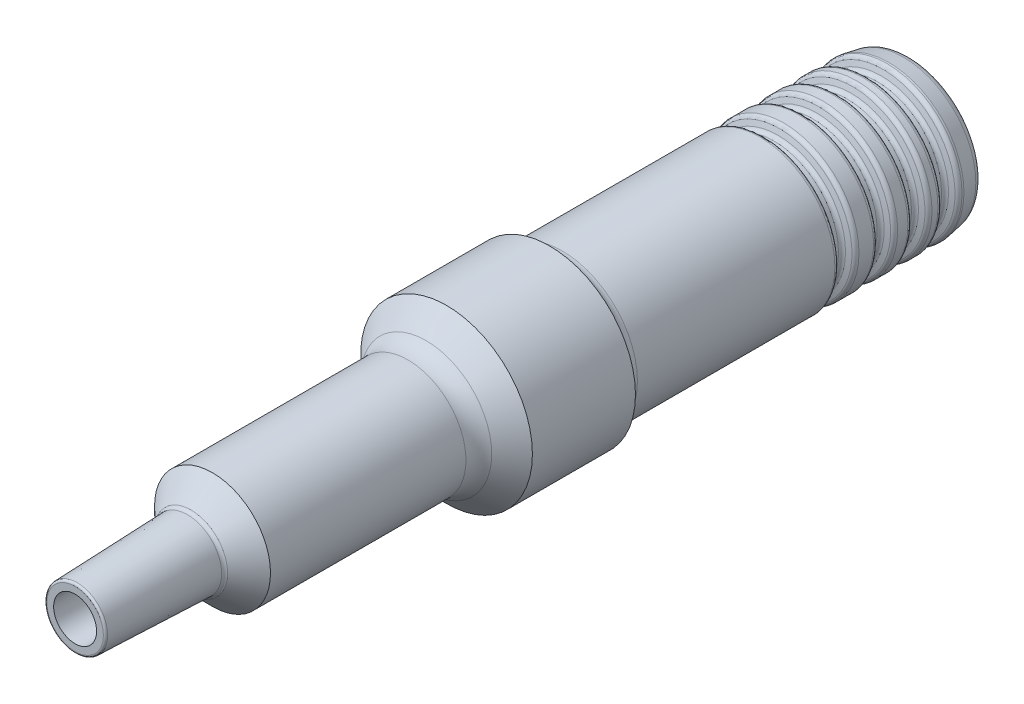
ISO-10303-21;
HEADER;
FILE_DESCRIPTION(('STEP AP214'),'2;1');
FILE_NAME('part.step','',(''),(''),'','','');
FILE_SCHEMA(('AUTOMOTIVE_DESIGN { 1 0 10303 214 1 1 1 1 }'));
ENDSEC;
DATA;
#1=APPLICATION_CONTEXT('core data for automotive mechanical design processes');
#2=APPLICATION_PROTOCOL_DEFINITION('international standard','automotive_design',2000,#1);
#3=PRODUCT_CONTEXT('',#1,'mechanical');
#4=PRODUCT('Part','Part','',(#3));
#5=PRODUCT_RELATED_PRODUCT_CATEGORY('part','',(#4));
#6=PRODUCT_DEFINITION_FORMATION('','',#4);
#7=PRODUCT_DEFINITION_CONTEXT('part definition',#1,'design');
#8=PRODUCT_DEFINITION('design','',#6,#7);
#9=PRODUCT_DEFINITION_SHAPE('','',#8);
#10=(LENGTH_UNIT() NAMED_UNIT(*) SI_UNIT(.MILLI.,.METRE.));
#11=(NAMED_UNIT(*) PLANE_ANGLE_UNIT() SI_UNIT($,.RADIAN.));
#12=(NAMED_UNIT(*) SI_UNIT($,.STERADIAN.) SOLID_ANGLE_UNIT());
#13=UNCERTAINTY_MEASURE_WITH_UNIT(LENGTH_MEASURE(1.E-05),#10,'distance_accuracy_value','');
#14=(GEOMETRIC_REPRESENTATION_CONTEXT(3) GLOBAL_UNCERTAINTY_ASSIGNED_CONTEXT((#13)) GLOBAL_UNIT_ASSIGNED_CONTEXT((#10,
#11,#12)) REPRESENTATION_CONTEXT('',''));
#15=CARTESIAN_POINT('',(0.,0.,0.));
#16=DIRECTION('',(0.,0.,1.));
#17=DIRECTION('',(1.,0.,0.));
#18=AXIS2_PLACEMENT_3D('',#15,#16,#17);
#19=CARTESIAN_POINT('',(0.,0.,-84.));
#20=DIRECTION('',(0.,0.,1.));
#21=DIRECTION('',(1.,0.,0.));
#22=AXIS2_PLACEMENT_3D('',#19,#20,#21);
#23=CYLINDRICAL_SURFACE('',#22,5.);
#24=CARTESIAN_POINT('',(0.,0.,57.5));
#25=DIRECTION('',(0.,0.,-1.));
#26=DIRECTION('',(-1.,0.,0.));
#27=AXIS2_PLACEMENT_3D('',#24,#25,#26);
#28=CIRCLE('',#27,5.);
#29=CARTESIAN_POINT('',(-5.,0.,57.5));
#30=VERTEX_POINT('',#29);
#31=EDGE_CURVE('E117',#30,#30,#28,.T.);
#32=ORIENTED_EDGE('',*,*,#31,.T.);
#33=EDGE_LOOP('',(#32));
#34=FACE_BOUND('',#33,.T.);
#35=CARTESIAN_POINT('',(0.,0.,110.5));
#36=DIRECTION('',(0.,0.,1.));
#37=DIRECTION('',(1.,0.,0.));
#38=AXIS2_PLACEMENT_3D('',#35,#36,#37);
#39=CIRCLE('',#38,5.);
#40=CARTESIAN_POINT('',(5.,0.,110.5));
#41=VERTEX_POINT('',#40);
#42=EDGE_CURVE('E192',#41,#41,#39,.T.);
#43=ORIENTED_EDGE('',*,*,#42,.T.);
#44=EDGE_LOOP('',(#43));
#45=FACE_BOUND('',#44,.T.);
#46=ADVANCED_FACE('F40',(#34,#45),#23,.F.);
#47=CARTESIAN_POINT('',(0.,0.,-84.));
#48=DIRECTION('',(0.,0.,1.));
#49=DIRECTION('',(1.,0.,0.));
#50=AXIS2_PLACEMENT_3D('',#47,#48,#49);
#51=CYLINDRICAL_SURFACE('',#50,17.5);
#52=CARTESIAN_POINT('',(0.,0.,-54.5540925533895));
#53=DIRECTION('',(0.,0.,-1.));
#54=DIRECTION('',(-1.,0.,0.));
#55=AXIS2_PLACEMENT_3D('',#52,#53,#54);
#56=CIRCLE('',#55,17.5);
#57=CARTESIAN_POINT('',(17.5,0.,-54.5540925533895));
#58=VERTEX_POINT('',#57);
#59=EDGE_CURVE('E123',#58,#58,#56,.T.);
#60=CARTESIAN_POINT('',(0.,0.,-57.9459074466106));
#61=DIRECTION('',(0.,0.,-1.));
#62=DIRECTION('',(-1.,0.,0.));
#63=AXIS2_PLACEMENT_3D('',#60,#61,#62);
#64=CIRCLE('',#63,17.5);
#65=CARTESIAN_POINT('',(17.5,0.,-57.9459074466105));
#66=VERTEX_POINT('',#65);
#67=EDGE_CURVE('E126',#66,#66,#64,.F.);
#68=CARTESIAN_POINT('',(17.5,0.,-54.5540925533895));
#69=CARTESIAN_POINT('',(17.5,0.,-54.5894239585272));
#70=CARTESIAN_POINT('',(17.5,0.,-54.6247553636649));
#71=CARTESIAN_POINT('',(17.5,0.,-54.6954181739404));
#72=CARTESIAN_POINT('',(17.5,0.,-54.7307495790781));
#73=CARTESIAN_POINT('',(17.5,0.,-54.8014123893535));
#74=CARTESIAN_POINT('',(17.5,0.,-54.8367437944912));
#75=CARTESIAN_POINT('',(17.5,0.,-54.9074066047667));
#76=CARTESIAN_POINT('',(17.5,0.,-54.9427380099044));
#77=CARTESIAN_POINT('',(17.5,0.,-55.0134008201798));
#78=CARTESIAN_POINT('',(17.5,0.,-55.0487322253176));
#79=CARTESIAN_POINT('',(17.5,0.,-55.119395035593));
#80=CARTESIAN_POINT('',(17.5,0.,-55.1547264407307));
#81=CARTESIAN_POINT('',(17.5,0.,-55.2253892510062));
#82=CARTESIAN_POINT('',(17.5,0.,-55.2607206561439));
#83=CARTESIAN_POINT('',(17.5,0.,-55.3313834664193));
#84=CARTESIAN_POINT('',(17.5,0.,-55.366714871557));
#85=CARTESIAN_POINT('',(17.5,0.,-55.4373776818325));
#86=CARTESIAN_POINT('',(17.5,0.,-55.4727090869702));
#87=CARTESIAN_POINT('',(17.5,0.,-55.5433718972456));
#88=CARTESIAN_POINT('',(17.5,0.,-55.5787033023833));
#89=CARTESIAN_POINT('',(17.5,0.,-55.6493661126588));
#90=CARTESIAN_POINT('',(17.5,0.,-55.6846975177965));
#91=CARTESIAN_POINT('',(17.5,0.,-55.7553603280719));
#92=CARTESIAN_POINT('',(17.5,0.,-55.7906917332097));
#93=CARTESIAN_POINT('',(17.5,0.,-55.8613545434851));
#94=CARTESIAN_POINT('',(17.5,0.,-55.8966859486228));
#95=CARTESIAN_POINT('',(17.5,0.,-55.9673487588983));
#96=CARTESIAN_POINT('',(17.5,0.,-56.002680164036));
#97=CARTESIAN_POINT('',(17.5,0.,-56.0733429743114));
#98=CARTESIAN_POINT('',(17.5,0.,-56.1086743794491));
#99=CARTESIAN_POINT('',(17.5,0.,-56.1793371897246));
#100=CARTESIAN_POINT('',(17.5,0.,-56.2146685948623));
#101=CARTESIAN_POINT('',(17.5,0.,-56.2853314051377));
#102=CARTESIAN_POINT('',(17.5,0.,-56.3206628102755));
#103=CARTESIAN_POINT('',(17.5,0.,-56.3913256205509));
#104=CARTESIAN_POINT('',(17.5,0.,-56.4266570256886));
#105=CARTESIAN_POINT('',(17.5,0.,-56.497319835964));
#106=CARTESIAN_POINT('',(17.5,0.,-56.5326512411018));
#107=CARTESIAN_POINT('',(17.5,0.,-56.6033140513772));
#108=CARTESIAN_POINT('',(17.5,0.,-56.6386454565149));
#109=CARTESIAN_POINT('',(17.5,0.,-56.7093082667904));
#110=CARTESIAN_POINT('',(17.5,0.,-56.7446396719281));
#111=CARTESIAN_POINT('',(17.5,0.,-56.8153024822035));
#112=CARTESIAN_POINT('',(17.5,0.,-56.8506338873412));
#113=CARTESIAN_POINT('',(17.5,0.,-56.9212966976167));
#114=CARTESIAN_POINT('',(17.5,0.,-56.9566281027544));
#115=CARTESIAN_POINT('',(17.5,0.,-57.0272909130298));
#116=CARTESIAN_POINT('',(17.5,0.,-57.0626223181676));
#117=CARTESIAN_POINT('',(17.5,0.,-57.133285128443));
#118=CARTESIAN_POINT('',(17.5,0.,-57.1686165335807));
#119=CARTESIAN_POINT('',(17.5,0.,-57.2392793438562));
#120=CARTESIAN_POINT('',(17.5,0.,-57.2746107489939));
#121=CARTESIAN_POINT('',(17.5,0.,-57.3452735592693));
#122=CARTESIAN_POINT('',(17.5,0.,-57.380604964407));
#123=CARTESIAN_POINT('',(17.5,0.,-57.4512677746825));
#124=CARTESIAN_POINT('',(17.5,0.,-57.4865991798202));
#125=CARTESIAN_POINT('',(17.5,0.,-57.5572619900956));
#126=CARTESIAN_POINT('',(17.5,0.,-57.5925933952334));
#127=CARTESIAN_POINT('',(17.5,0.,-57.6632562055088));
#128=CARTESIAN_POINT('',(17.5,0.,-57.6985876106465));
#129=CARTESIAN_POINT('',(17.5,0.,-57.7692504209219));
#130=CARTESIAN_POINT('',(17.5,0.,-57.8045818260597));
#131=CARTESIAN_POINT('',(17.5,0.,-57.8752446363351));
#132=CARTESIAN_POINT('',(17.5,0.,-57.9105760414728));
#133=CARTESIAN_POINT('',(17.5,0.,-57.9459074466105));
#134=B_SPLINE_CURVE_WITH_KNOTS('',3,(#68,#69,#70,#71,#72,#73,#74,#75,#76,#77,#78,#79,#80,#81,
#82,#83,#84,#85,#86,#87,#88,#89,#90,#91,#92,#93,#94,#95,#96,#97,#98,#99,#100,#101,#102,#103,
#104,#105,#106,#107,#108,#109,#110,#111,#112,#113,#114,#115,#116,#117,#118,#119,#120,#121,#122,
#123,#124,#125,#126,#127,#128,#129,#130,#131,#132,#133),.UNSPECIFIED.,.F.,.F.,(4,2,2,2,2,2,2,2,
2,2,2,2,2,2,2,2,2,2,2,2,2,2,2,2,2,2,2,2,2,2,2,2,4),(0.,0.105994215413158,0.211988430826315,
0.317982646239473,0.423976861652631,0.529971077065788,0.635965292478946,0.741959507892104,
0.847953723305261,0.953947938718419,1.05994215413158,1.16593636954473,1.27193058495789,
1.37792480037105,1.48391901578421,1.58991323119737,1.69590744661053,1.80190166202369,
1.90789587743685,2.01389009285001,2.11988430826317,2.22587852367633,2.33187273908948,
2.43786695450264,2.5438611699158,2.64985538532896,2.75584960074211,2.86184381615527,
2.96783803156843,3.07383224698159,3.17982646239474,3.2858206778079,3.39181489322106),.UNSPECIFIED.);
#135=EDGE_CURVE('BSEAM228',#58,#66,#134,.T.);
#136=ORIENTED_EDGE('',*,*,#59,.T.);
#137=ORIENTED_EDGE('',*,*,#67,.T.);
#138=ORIENTED_EDGE('',*,*,#135,.T.);
#139=ORIENTED_EDGE('',*,*,#135,.F.);
#140=EDGE_LOOP('',(#136,#138,#137,#139));
#141=FACE_BOUND('',#140,.T.);
#142=ADVANCED_FACE('F228',(#141),#51,.T.);
#143=CARTESIAN_POINT('',(0.,0.,-71.5540925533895));
#144=DIRECTION('',(0.,0.,-1.));
#145=DIRECTION('',(-1.,0.,0.));
#146=AXIS2_PLACEMENT_3D('',#143,#144,#145);
#147=CIRCLE('',#146,17.5);
#148=CARTESIAN_POINT('',(17.5,0.,-71.5540925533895));
#149=VERTEX_POINT('',#148);
#150=EDGE_CURVE('E153',#149,#149,#147,.T.);
#151=CARTESIAN_POINT('',(0.,0.,-72.9459074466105));
#152=DIRECTION('',(0.,0.,-1.));
#153=DIRECTION('',(-1.,0.,0.));
#154=AXIS2_PLACEMENT_3D('',#151,#152,#153);
#155=CIRCLE('',#154,17.5);
#156=CARTESIAN_POINT('',(17.5,0.,-72.9459074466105));
#157=VERTEX_POINT('',#156);
#158=EDGE_CURVE('E156',#157,#157,#155,.F.);
#159=CARTESIAN_POINT('',(17.5,0.,-71.5540925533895));
#160=CARTESIAN_POINT('',(17.5,0.,-71.5685906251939));
#161=CARTESIAN_POINT('',(17.5,0.,-71.5830886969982));
#162=CARTESIAN_POINT('',(17.5,0.,-71.612084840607));
#163=CARTESIAN_POINT('',(17.5,0.,-71.6265829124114));
#164=CARTESIAN_POINT('',(17.5,0.,-71.6555790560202));
#165=CARTESIAN_POINT('',(17.5,0.,-71.6700771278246));
#166=CARTESIAN_POINT('',(17.5,0.,-71.6990732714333));
#167=CARTESIAN_POINT('',(17.5,0.,-71.7135713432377));
#168=CARTESIAN_POINT('',(17.5,0.,-71.7425674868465));
#169=CARTESIAN_POINT('',(17.5,0.,-71.7570655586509));
#170=CARTESIAN_POINT('',(17.5,0.,-71.7860617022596));
#171=CARTESIAN_POINT('',(17.5,0.,-71.800559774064));
#172=CARTESIAN_POINT('',(17.5,0.,-71.8295559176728));
#173=CARTESIAN_POINT('',(17.5,0.,-71.8440539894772));
#174=CARTESIAN_POINT('',(17.5,0.,-71.873050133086));
#175=CARTESIAN_POINT('',(17.5,0.,-71.8875482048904));
#176=CARTESIAN_POINT('',(17.5,0.,-71.9165443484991));
#177=CARTESIAN_POINT('',(17.5,0.,-71.9310424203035));
#178=CARTESIAN_POINT('',(17.5,0.,-71.9600385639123));
#179=CARTESIAN_POINT('',(17.5,0.,-71.9745366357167));
#180=CARTESIAN_POINT('',(17.5,0.,-72.0035327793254));
#181=CARTESIAN_POINT('',(17.5,0.,-72.0180308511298));
#182=CARTESIAN_POINT('',(17.5,0.,-72.0470269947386));
#183=CARTESIAN_POINT('',(17.5,0.,-72.061525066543));
#184=CARTESIAN_POINT('',(17.5,0.,-72.0905212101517));
#185=CARTESIAN_POINT('',(17.5,0.,-72.1050192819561));
#186=CARTESIAN_POINT('',(17.5,0.,-72.1340154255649));
#187=CARTESIAN_POINT('',(17.5,0.,-72.1485134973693));
#188=CARTESIAN_POINT('',(17.5,0.,-72.1775096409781));
#189=CARTESIAN_POINT('',(17.5,0.,-72.1920077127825));
#190=CARTESIAN_POINT('',(17.5,0.,-72.2210038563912));
#191=CARTESIAN_POINT('',(17.5,0.,-72.2355019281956));
#192=CARTESIAN_POINT('',(17.5,0.,-72.2644980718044));
#193=CARTESIAN_POINT('',(17.5,0.,-72.2789961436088));
#194=CARTESIAN_POINT('',(17.5,0.,-72.3079922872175));
#195=CARTESIAN_POINT('',(17.5,0.,-72.3224903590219));
#196=CARTESIAN_POINT('',(17.5,0.,-72.3514865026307));
#197=CARTESIAN_POINT('',(17.5,0.,-72.3659845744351));
#198=CARTESIAN_POINT('',(17.5,0.,-72.3949807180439));
#199=CARTESIAN_POINT('',(17.5,0.,-72.4094787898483));
#200=CARTESIAN_POINT('',(17.5,0.,-72.438474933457));
#201=CARTESIAN_POINT('',(17.5,0.,-72.4529730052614));
#202=CARTESIAN_POINT('',(17.5,0.,-72.4819691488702));
#203=CARTESIAN_POINT('',(17.5,0.,-72.4964672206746));
#204=CARTESIAN_POINT('',(17.5,0.,-72.5254633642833));
#205=CARTESIAN_POINT('',(17.5,0.,-72.5399614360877));
#206=CARTESIAN_POINT('',(17.5,0.,-72.5689575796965));
#207=CARTESIAN_POINT('',(17.5,0.,-72.5834556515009));
#208=CARTESIAN_POINT('',(17.5,0.,-72.6124517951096));
#209=CARTESIAN_POINT('',(17.5,0.,-72.626949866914));
#210=CARTESIAN_POINT('',(17.5,0.,-72.6559460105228));
#211=CARTESIAN_POINT('',(17.5,0.,-72.6704440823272));
#212=CARTESIAN_POINT('',(17.5,0.,-72.699440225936));
#213=CARTESIAN_POINT('',(17.5,0.,-72.7139382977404));
#214=CARTESIAN_POINT('',(17.5,0.,-72.7429344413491));
#215=CARTESIAN_POINT('',(17.5,0.,-72.7574325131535));
#216=CARTESIAN_POINT('',(17.5,0.,-72.7864286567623));
#217=CARTESIAN_POINT('',(17.5,0.,-72.8009267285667));
#218=CARTESIAN_POINT('',(17.5,0.,-72.8299228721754));
#219=CARTESIAN_POINT('',(17.5,0.,-72.8444209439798));
#220=CARTESIAN_POINT('',(17.5,0.,-72.8734170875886));
#221=CARTESIAN_POINT('',(17.5,0.,-72.887915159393));
#222=CARTESIAN_POINT('',(17.5,0.,-72.9169113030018));
#223=CARTESIAN_POINT('',(17.5,0.,-72.9314093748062));
#224=CARTESIAN_POINT('',(17.5,0.,-72.9459074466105));
#225=B_SPLINE_CURVE_WITH_KNOTS('',3,(#159,#160,#161,#162,#163,#164,#165,#166,#167,#168,#169,
#170,#171,#172,#173,#174,#175,#176,#177,#178,#179,#180,#181,#182,#183,#184,#185,#186,#187,#188,
#189,#190,#191,#192,#193,#194,#195,#196,#197,#198,#199,#200,#201,#202,#203,#204,#205,#206,#207,
#208,#209,#210,#211,#212,#213,#214,#215,#216,#217,#218,#219,#220,#221,#222,#223,#224),
.UNSPECIFIED.,.F.,.F.,(4,2,2,2,2,2,2,2,2,2,2,2,2,2,2,2,2,2,2,2,2,2,2,2,2,2,2,2,2,2,2,2,4),(0.,
0.0434942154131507,0.0869884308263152,0.130482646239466,0.17397686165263,0.217471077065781,
0.260965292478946,0.30445950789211,0.347953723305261,0.391447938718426,0.434942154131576,
0.478436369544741,0.521930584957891,0.565424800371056,0.608919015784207,0.652413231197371,
0.695907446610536,0.739401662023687,0.782895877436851,0.826390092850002,0.869884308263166,
0.913378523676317,0.956872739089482,1.00036695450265,1.0438611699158,1.08735538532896,
1.13084960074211,1.17434381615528,1.21783803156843,1.26133224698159,1.30482646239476,
1.34832067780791,1.39181489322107),.UNSPECIFIED.);
#226=EDGE_CURVE('BSEAM235',#149,#157,#225,.T.);
#227=ORIENTED_EDGE('',*,*,#150,.T.);
#228=ORIENTED_EDGE('',*,*,#158,.T.);
#229=ORIENTED_EDGE('',*,*,#226,.T.);
#230=ORIENTED_EDGE('',*,*,#226,.F.);
#231=EDGE_LOOP('',(#227,#229,#228,#230));
#232=FACE_BOUND('',#231,.T.);
#233=ADVANCED_FACE('F235',(#232),#51,.T.);
#234=CARTESIAN_POINT('',(0.,0.,-63.5540925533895));
#235=DIRECTION('',(0.,0.,-1.));
#236=DIRECTION('',(-1.,0.,0.));
#237=AXIS2_PLACEMENT_3D('',#234,#235,#236);
#238=CIRCLE('',#237,17.5);
#239=CARTESIAN_POINT('',(17.5,0.,-63.5540925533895));
#240=VERTEX_POINT('',#239);
#241=EDGE_CURVE('E135',#240,#240,#238,.T.);
#242=CARTESIAN_POINT('',(0.,0.,-65.9459074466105));
#243=DIRECTION('',(0.,0.,-1.));
#244=DIRECTION('',(-1.,0.,0.));
#245=AXIS2_PLACEMENT_3D('',#242,#243,#244);
#246=CIRCLE('',#245,17.5);
#247=CARTESIAN_POINT('',(17.5,0.,-65.9459074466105));
#248=VERTEX_POINT('',#247);
#249=EDGE_CURVE('E138',#248,#248,#246,.F.);
#250=CARTESIAN_POINT('',(17.5,0.,-63.5540925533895));
#251=CARTESIAN_POINT('',(17.5,0.,-63.5790072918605));
#252=CARTESIAN_POINT('',(17.5,0.,-63.6039220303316));
#253=CARTESIAN_POINT('',(17.5,0.,-63.6537515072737));
#254=CARTESIAN_POINT('',(17.5,0.,-63.6786662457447));
#255=CARTESIAN_POINT('',(17.5,0.,-63.7284957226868));
#256=CARTESIAN_POINT('',(17.5,0.,-63.7534104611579));
#257=CARTESIAN_POINT('',(17.5,0.,-63.8032399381));
#258=CARTESIAN_POINT('',(17.5,0.,-63.828154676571));
#259=CARTESIAN_POINT('',(17.5,0.,-63.8779841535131));
#260=CARTESIAN_POINT('',(17.5,0.,-63.9028988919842));
#261=CARTESIAN_POINT('',(17.5,0.,-63.9527283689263));
#262=CARTESIAN_POINT('',(17.5,0.,-63.9776431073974));
#263=CARTESIAN_POINT('',(17.5,0.,-64.0274725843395));
#264=CARTESIAN_POINT('',(17.5,0.,-64.0523873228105));
#265=CARTESIAN_POINT('',(17.5,0.,-64.1022167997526));
#266=CARTESIAN_POINT('',(17.5,0.,-64.1271315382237));
#267=CARTESIAN_POINT('',(17.5,0.,-64.1769610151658));
#268=CARTESIAN_POINT('',(17.5,0.,-64.2018757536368));
#269=CARTESIAN_POINT('',(17.5,0.,-64.2517052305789));
#270=CARTESIAN_POINT('',(17.5,0.,-64.27661996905));
#271=CARTESIAN_POINT('',(17.5,0.,-64.3264494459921));
#272=CARTESIAN_POINT('',(17.5,0.,-64.3513641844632));
#273=CARTESIAN_POINT('',(17.5,0.,-64.4011936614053));
#274=CARTESIAN_POINT('',(17.5,0.,-64.4261083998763));
#275=CARTESIAN_POINT('',(17.5,0.,-64.4759378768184));
#276=CARTESIAN_POINT('',(17.5,0.,-64.5008526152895));
#277=CARTESIAN_POINT('',(17.5,0.,-64.5506820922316));
#278=CARTESIAN_POINT('',(17.5,0.,-64.5755968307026));
#279=CARTESIAN_POINT('',(17.5,0.,-64.6254263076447));
#280=CARTESIAN_POINT('',(17.5,0.,-64.6503410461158));
#281=CARTESIAN_POINT('',(17.5,0.,-64.7001705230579));
#282=CARTESIAN_POINT('',(17.5,0.,-64.7250852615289));
#283=CARTESIAN_POINT('',(17.5,0.,-64.774914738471));
#284=CARTESIAN_POINT('',(17.5,0.,-64.7998294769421));
#285=CARTESIAN_POINT('',(17.5,0.,-64.8496589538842));
#286=CARTESIAN_POINT('',(17.5,0.,-64.8745736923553));
#287=CARTESIAN_POINT('',(17.5,0.,-64.9244031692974));
#288=CARTESIAN_POINT('',(17.5,0.,-64.9493179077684));
#289=CARTESIAN_POINT('',(17.5,0.,-64.9991473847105));
#290=CARTESIAN_POINT('',(17.5,0.,-65.0240621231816));
#291=CARTESIAN_POINT('',(17.5,0.,-65.0738916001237));
#292=CARTESIAN_POINT('',(17.5,0.,-65.0988063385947));
#293=CARTESIAN_POINT('',(17.5,0.,-65.1486358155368));
#294=CARTESIAN_POINT('',(17.5,0.,-65.1735505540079));
#295=CARTESIAN_POINT('',(17.5,0.,-65.22338003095));
#296=CARTESIAN_POINT('',(17.5,0.,-65.248294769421));
#297=CARTESIAN_POINT('',(17.5,0.,-65.2981242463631));
#298=CARTESIAN_POINT('',(17.5,0.,-65.3230389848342));
#299=CARTESIAN_POINT('',(17.5,0.,-65.3728684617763));
#300=CARTESIAN_POINT('',(17.5,0.,-65.3977832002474));
#301=CARTESIAN_POINT('',(17.5,0.,-65.4476126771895));
#302=CARTESIAN_POINT('',(17.5,0.,-65.4725274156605));
#303=CARTESIAN_POINT('',(17.5,0.,-65.5223568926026));
#304=CARTESIAN_POINT('',(17.5,0.,-65.5472716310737));
#305=CARTESIAN_POINT('',(17.5,0.,-65.5971011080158));
#306=CARTESIAN_POINT('',(17.5,0.,-65.6220158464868));
#307=CARTESIAN_POINT('',(17.5,0.,-65.6718453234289));
#308=CARTESIAN_POINT('',(17.5,0.,-65.6967600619));
#309=CARTESIAN_POINT('',(17.5,0.,-65.7465895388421));
#310=CARTESIAN_POINT('',(17.5,0.,-65.7715042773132));
#311=CARTESIAN_POINT('',(17.5,0.,-65.8213337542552));
#312=CARTESIAN_POINT('',(17.5,0.,-65.8462484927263));
#313=CARTESIAN_POINT('',(17.5,0.,-65.8960779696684));
#314=CARTESIAN_POINT('',(17.5,0.,-65.9209927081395));
#315=CARTESIAN_POINT('',(17.5,0.,-65.9459074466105));
#316=B_SPLINE_CURVE_WITH_KNOTS('',3,(#250,#251,#252,#253,#254,#255,#256,#257,#258,#259,#260,
#261,#262,#263,#264,#265,#266,#267,#268,#269,#270,#271,#272,#273,#274,#275,#276,#277,#278,#279,
#280,#281,#282,#283,#284,#285,#286,#287,#288,#289,#290,#291,#292,#293,#294,#295,#296,#297,#298,
#299,#300,#301,#302,#303,#304,#305,#306,#307,#308,#309,#310,#311,#312,#313,#314,#315),
.UNSPECIFIED.,.F.,.F.,(4,2,2,2,2,2,2,2,2,2,2,2,2,2,2,2,2,2,2,2,2,2,2,2,2,2,2,2,2,2,2,2,4),(0.,
0.0747442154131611,0.149488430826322,0.224232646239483,0.298976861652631,0.373721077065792,
0.448465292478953,0.5232095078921,0.597953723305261,0.672697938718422,0.747442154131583,
0.822186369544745,0.896930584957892,0.971674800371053,1.04641901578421,1.12116323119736,
1.19590744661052,1.27065166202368,1.34539587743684,1.42014009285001,1.49488430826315,
1.56962852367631,1.64437273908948,1.71911695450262,1.79386116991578,1.86860538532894,
1.94334960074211,2.01809381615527,2.09283803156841,2.16758224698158,2.24232646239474,
2.31707067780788,2.39181489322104),.UNSPECIFIED.);
#317=EDGE_CURVE('BSEAM278',#240,#248,#316,.T.);
#318=ORIENTED_EDGE('',*,*,#241,.T.);
#319=ORIENTED_EDGE('',*,*,#249,.T.);
#320=ORIENTED_EDGE('',*,*,#317,.T.);
#321=ORIENTED_EDGE('',*,*,#317,.F.);
#322=EDGE_LOOP('',(#318,#320,#319,#321));
#323=FACE_BOUND('',#322,.T.);
#324=ADVANCED_FACE('F278',(#323),#51,.T.);
#325=CARTESIAN_POINT('',(0.,0.,-78.5540925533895));
#326=DIRECTION('',(0.,0.,-1.));
#327=DIRECTION('',(-1.,0.,0.));
#328=AXIS2_PLACEMENT_3D('',#325,#326,#327);
#329=CIRCLE('',#328,17.5);
#330=CARTESIAN_POINT('',(17.5,0.,-78.5540925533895));
#331=VERTEX_POINT('',#330);
#332=EDGE_CURVE('E144',#331,#331,#329,.T.);
#333=CARTESIAN_POINT('',(0.,0.,-79.));
#334=DIRECTION('',(0.,0.,-1.));
#335=DIRECTION('',(-1.,0.,0.));
#336=AXIS2_PLACEMENT_3D('',#333,#334,#335);
#337=CIRCLE('',#336,17.5);
#338=CARTESIAN_POINT('',(17.5,0.,-79.));
#339=VERTEX_POINT('',#338);
#340=EDGE_CURVE('E174',#339,#339,#337,.F.);
#341=CARTESIAN_POINT('',(17.5,0.,-78.5540925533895));
#342=CARTESIAN_POINT('',(17.5,0.,-78.558737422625));
#343=CARTESIAN_POINT('',(17.5,0.,-78.5633822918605));
#344=CARTESIAN_POINT('',(17.5,0.,-78.5726720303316));
#345=CARTESIAN_POINT('',(17.5,0.,-78.5773168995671));
#346=CARTESIAN_POINT('',(17.5,0.,-78.5866066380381));
#347=CARTESIAN_POINT('',(17.5,0.,-78.5912515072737));
#348=CARTESIAN_POINT('',(17.5,0.,-78.6005412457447));
#349=CARTESIAN_POINT('',(17.5,0.,-78.6051861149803));
#350=CARTESIAN_POINT('',(17.5,0.,-78.6144758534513));
#351=CARTESIAN_POINT('',(17.5,0.,-78.6191207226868));
#352=CARTESIAN_POINT('',(17.5,0.,-78.6284104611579));
#353=CARTESIAN_POINT('',(17.5,0.,-78.6330553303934));
#354=CARTESIAN_POINT('',(17.5,0.,-78.6423450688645));
#355=CARTESIAN_POINT('',(17.5,0.,-78.6469899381));
#356=CARTESIAN_POINT('',(17.5,0.,-78.6562796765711));
#357=CARTESIAN_POINT('',(17.5,0.,-78.6609245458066));
#358=CARTESIAN_POINT('',(17.5,0.,-78.6702142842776));
#359=CARTESIAN_POINT('',(17.5,0.,-78.6748591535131));
#360=CARTESIAN_POINT('',(17.5,0.,-78.6841488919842));
#361=CARTESIAN_POINT('',(17.5,0.,-78.6887937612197));
#362=CARTESIAN_POINT('',(17.5,0.,-78.6980834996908));
#363=CARTESIAN_POINT('',(17.5,0.,-78.7027283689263));
#364=CARTESIAN_POINT('',(17.5,0.,-78.7120181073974));
#365=CARTESIAN_POINT('',(17.5,0.,-78.7166629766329));
#366=CARTESIAN_POINT('',(17.5,0.,-78.7259527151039));
#367=CARTESIAN_POINT('',(17.5,0.,-78.7305975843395));
#368=CARTESIAN_POINT('',(17.5,0.,-78.7398873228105));
#369=CARTESIAN_POINT('',(17.5,0.,-78.7445321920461));
#370=CARTESIAN_POINT('',(17.5,0.,-78.7538219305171));
#371=CARTESIAN_POINT('',(17.5,0.,-78.7584667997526));
#372=CARTESIAN_POINT('',(17.5,0.,-78.7677565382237));
#373=CARTESIAN_POINT('',(17.5,0.,-78.7724014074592));
#374=CARTESIAN_POINT('',(17.5,0.,-78.7816911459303));
#375=CARTESIAN_POINT('',(17.5,0.,-78.7863360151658));
#376=CARTESIAN_POINT('',(17.5,0.,-78.7956257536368));
#377=CARTESIAN_POINT('',(17.5,0.,-78.8002706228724));
#378=CARTESIAN_POINT('',(17.5,0.,-78.8095603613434));
#379=CARTESIAN_POINT('',(17.5,0.,-78.8142052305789));
#380=CARTESIAN_POINT('',(17.5,0.,-78.82349496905));
#381=CARTESIAN_POINT('',(17.5,0.,-78.8281398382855));
#382=CARTESIAN_POINT('',(17.5,0.,-78.8374295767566));
#383=CARTESIAN_POINT('',(17.5,0.,-78.8420744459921));
#384=CARTESIAN_POINT('',(17.5,0.,-78.8513641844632));
#385=CARTESIAN_POINT('',(17.5,0.,-78.8560090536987));
#386=CARTESIAN_POINT('',(17.5,0.,-78.8652987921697));
#387=CARTESIAN_POINT('',(17.5,0.,-78.8699436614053));
#388=CARTESIAN_POINT('',(17.5,0.,-78.8792333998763));
#389=CARTESIAN_POINT('',(17.5,0.,-78.8838782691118));
#390=CARTESIAN_POINT('',(17.5,0.,-78.8931680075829));
#391=CARTESIAN_POINT('',(17.5,0.,-78.8978128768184));
#392=CARTESIAN_POINT('',(17.5,0.,-78.9071026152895));
#393=CARTESIAN_POINT('',(17.5,0.,-78.911747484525));
#394=CARTESIAN_POINT('',(17.5,0.,-78.921037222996));
#395=CARTESIAN_POINT('',(17.5,0.,-78.9256820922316));
#396=CARTESIAN_POINT('',(17.5,0.,-78.9349718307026));
#397=CARTESIAN_POINT('',(17.5,0.,-78.9396166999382));
#398=CARTESIAN_POINT('',(17.5,0.,-78.9489064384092));
#399=CARTESIAN_POINT('',(17.5,0.,-78.9535513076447));
#400=CARTESIAN_POINT('',(17.5,0.,-78.9628410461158));
#401=CARTESIAN_POINT('',(17.5,0.,-78.9674859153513));
#402=CARTESIAN_POINT('',(17.5,0.,-78.9767756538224));
#403=CARTESIAN_POINT('',(17.5,0.,-78.9814205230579));
#404=CARTESIAN_POINT('',(17.5,0.,-78.9907102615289));
#405=CARTESIAN_POINT('',(17.5,0.,-78.9953551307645));
#406=CARTESIAN_POINT('',(17.5,0.,-79.));
#407=B_SPLINE_CURVE_WITH_KNOTS('',3,(#341,#342,#343,#344,#345,#346,#347,#348,#349,#350,#351,
#352,#353,#354,#355,#356,#357,#358,#359,#360,#361,#362,#363,#364,#365,#366,#367,#368,#369,#370,
#371,#372,#373,#374,#375,#376,#377,#378,#379,#380,#381,#382,#383,#384,#385,#386,#387,#388,#389,
#390,#391,#392,#393,#394,#395,#396,#397,#398,#399,#400,#401,#402,#403,#404,#405,#406),
.UNSPECIFIED.,.F.,.F.,(4,2,2,2,2,2,2,2,2,2,2,2,2,2,2,2,2,2,2,2,2,2,2,2,2,2,2,2,2,2,2,2,4),(0.,
0.0139346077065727,0.0278692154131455,0.0418038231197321,0.0557384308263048,0.0696730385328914,
0.0836076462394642,0.0975422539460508,0.111476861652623,0.125411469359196,0.139346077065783,
0.153280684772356,0.167215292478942,0.181149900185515,0.195084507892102,0.209019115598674,
0.222953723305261,0.236888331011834,0.250822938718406,0.264757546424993,0.278692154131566,
0.292626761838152,0.306561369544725,0.320495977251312,0.334430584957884,0.348365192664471,
0.362299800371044,0.376234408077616,0.390169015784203,0.404103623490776,0.418038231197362,
0.431972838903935,0.445907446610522),.UNSPECIFIED.);
#408=EDGE_CURVE('BSEAM269',#331,#339,#407,.T.);
#409=ORIENTED_EDGE('',*,*,#332,.T.);
#410=ORIENTED_EDGE('',*,*,#340,.T.);
#411=ORIENTED_EDGE('',*,*,#408,.T.);
#412=ORIENTED_EDGE('',*,*,#408,.F.);
#413=EDGE_LOOP('',(#409,#411,#410,#412));
#414=FACE_BOUND('',#413,.T.);
#415=ADVANCED_FACE('F269',(#414),#51,.T.);
#416=CARTESIAN_POINT('',(0.,0.,32.9852813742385));
#417=DIRECTION('',(0.,0.,-1.));
#418=DIRECTION('',(-1.,0.,0.));
#419=AXIS2_PLACEMENT_3D('',#416,#417,#418);
#420=TOROIDAL_SURFACE('',#419,19.5,6.);
#421=CARTESIAN_POINT('',(0.,0.,28.7426406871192));
#422=DIRECTION('',(0.,0.,1.));
#423=DIRECTION('',(1.,0.,0.));
#424=AXIS2_PLACEMENT_3D('',#421,#422,#423);
#425=CIRCLE('',#424,15.2573593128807);
#426=CARTESIAN_POINT('',(15.2573593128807,0.,28.7426406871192));
#427=VERTEX_POINT('',#426);
#428=EDGE_CURVE('E180',#427,#427,#425,.F.);
#429=ORIENTED_EDGE('',*,*,#428,.F.);
#430=EDGE_LOOP('',(#429));
#431=FACE_BOUND('',#430,.T.);
#432=CARTESIAN_POINT('',(0.,0.,32.9852813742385));
#433=DIRECTION('',(0.,0.,-1.));
#434=DIRECTION('',(-1.,0.,0.));
#435=AXIS2_PLACEMENT_3D('',#432,#433,#434);
#436=CIRCLE('',#435,13.5);
#437=CARTESIAN_POINT('',(-13.5,0.,32.9852813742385));
#438=VERTEX_POINT('',#437);
#439=EDGE_CURVE('E177',#438,#438,#436,.F.);
#440=ORIENTED_EDGE('',*,*,#439,.F.);
#441=EDGE_LOOP('',(#440));
#442=FACE_BOUND('',#441,.T.);
#443=ADVANCED_FACE('F271',(#431,#442),#420,.F.);
#444=CARTESIAN_POINT('',(0.,0.,30.));
#445=DIRECTION('',(0.,0.,-1.));
#446=DIRECTION('',(-1.,0.,0.));
#447=AXIS2_PLACEMENT_3D('',#444,#445,#446);
#448=CYLINDRICAL_SURFACE('',#447,20.);
#449=CARTESIAN_POINT('',(0.,0.,24.));
#450=DIRECTION('',(0.,0.,1.));
#451=DIRECTION('',(1.,0.,0.));
#452=AXIS2_PLACEMENT_3D('',#449,#450,#451);
#453=CIRCLE('',#452,20.);
#454=CARTESIAN_POINT('',(20.,0.,24.));
#455=VERTEX_POINT('',#454);
#456=EDGE_CURVE('E183',#455,#455,#453,.F.);
#457=ORIENTED_EDGE('',*,*,#456,.T.);
#458=EDGE_LOOP('',(#457));
#459=FACE_BOUND('',#458,.T.);
#460=CARTESIAN_POINT('',(0.,0.,0.));
#461=DIRECTION('',(0.,0.,1.));
#462=DIRECTION('',(1.,0.,0.));
#463=AXIS2_PLACEMENT_3D('',#460,#461,#462);
#464=CIRCLE('',#463,20.);
#465=CARTESIAN_POINT('',(20.,0.,0.));
#466=VERTEX_POINT('',#465);
#467=EDGE_CURVE('E189',#466,#466,#464,.T.);
#468=ORIENTED_EDGE('',*,*,#467,.T.);
#469=EDGE_LOOP('',(#468));
#470=FACE_BOUND('',#469,.T.);
#471=ADVANCED_FACE('F267',(#459,#470),#448,.T.);
#472=CARTESIAN_POINT('',(0.,0.,-48.9459074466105));
#473=DIRECTION('',(0.,0.,-1.));
#474=DIRECTION('',(-1.,0.,0.));
#475=AXIS2_PLACEMENT_3D('',#472,#473,#474);
#476=CIRCLE('',#475,17.5);
#477=CARTESIAN_POINT('',(17.5,0.,-48.9459074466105));
#478=VERTEX_POINT('',#477);
#479=EDGE_CURVE('E114',#478,#478,#476,.F.);
#480=CARTESIAN_POINT('',(0.,0.,-2.95803989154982));
#481=DIRECTION('',(0.,0.,1.));
#482=DIRECTION('',(1.,0.,0.));
#483=AXIS2_PLACEMENT_3D('',#480,#481,#482);
#484=CIRCLE('',#483,17.5);
#485=CARTESIAN_POINT('',(17.5,0.,-2.95803989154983));
#486=VERTEX_POINT('',#485);
#487=EDGE_CURVE('E186',#486,#486,#484,.F.);
#488=CARTESIAN_POINT('',(17.5,0.,-48.9459074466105));
#489=CARTESIAN_POINT('',(17.5,0.,-48.4668671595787));
#490=CARTESIAN_POINT('',(17.5,0.,-47.9878268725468));
#491=CARTESIAN_POINT('',(17.5,0.,-47.029746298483));
#492=CARTESIAN_POINT('',(17.5,0.,-46.5507060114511));
#493=CARTESIAN_POINT('',(17.5,0.,-45.5926254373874));
#494=CARTESIAN_POINT('',(17.5,0.,-45.1135851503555));
#495=CARTESIAN_POINT('',(17.5,0.,-44.1555045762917));
#496=CARTESIAN_POINT('',(17.5,0.,-43.6764642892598));
#497=CARTESIAN_POINT('',(17.5,0.,-42.7183837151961));
#498=CARTESIAN_POINT('',(17.5,0.,-42.2393434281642));
#499=CARTESIAN_POINT('',(17.5,0.,-41.2812628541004));
#500=CARTESIAN_POINT('',(17.5,0.,-40.8022225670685));
#501=CARTESIAN_POINT('',(17.5,0.,-39.8441419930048));
#502=CARTESIAN_POINT('',(17.5,0.,-39.3651017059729));
#503=CARTESIAN_POINT('',(17.5,0.,-38.4070211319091));
#504=CARTESIAN_POINT('',(17.5,0.,-37.9279808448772));
#505=CARTESIAN_POINT('',(17.5,0.,-36.9699002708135));
#506=CARTESIAN_POINT('',(17.5,0.,-36.4908599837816));
#507=CARTESIAN_POINT('',(17.5,0.,-35.5327794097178));
#508=CARTESIAN_POINT('',(17.5,0.,-35.053739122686));
#509=CARTESIAN_POINT('',(17.5,0.,-34.0956585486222));
#510=CARTESIAN_POINT('',(17.5,0.,-33.6166182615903));
#511=CARTESIAN_POINT('',(17.5,0.,-32.6585376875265));
#512=CARTESIAN_POINT('',(17.5,0.,-32.1794974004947));
#513=CARTESIAN_POINT('',(17.5,0.,-31.2214168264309));
#514=CARTESIAN_POINT('',(17.5,0.,-30.742376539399));
#515=CARTESIAN_POINT('',(17.5,0.,-29.7842959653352));
#516=CARTESIAN_POINT('',(17.5,0.,-29.3052556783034));
#517=CARTESIAN_POINT('',(17.5,0.,-28.3471751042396));
#518=CARTESIAN_POINT('',(17.5,0.,-27.8681348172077));
#519=CARTESIAN_POINT('',(17.5,0.,-26.910054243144));
#520=CARTESIAN_POINT('',(17.5,0.,-26.4310139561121));
#521=CARTESIAN_POINT('',(17.5,0.,-25.4729333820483));
#522=CARTESIAN_POINT('',(17.5,0.,-24.9938930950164));
#523=CARTESIAN_POINT('',(17.5,0.,-24.0358125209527));
#524=CARTESIAN_POINT('',(17.5,0.,-23.5567722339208));
#525=CARTESIAN_POINT('',(17.5,0.,-22.598691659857));
#526=CARTESIAN_POINT('',(17.5,0.,-22.1196513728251));
#527=CARTESIAN_POINT('',(17.5,0.,-21.1615707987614));
#528=CARTESIAN_POINT('',(17.5,0.,-20.6825305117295));
#529=CARTESIAN_POINT('',(17.5,0.,-19.7244499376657));
#530=CARTESIAN_POINT('',(17.5,0.,-19.2454096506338));
#531=CARTESIAN_POINT('',(17.5,0.,-18.2873290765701));
#532=CARTESIAN_POINT('',(17.5,0.,-17.8082887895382));
#533=CARTESIAN_POINT('',(17.5,0.,-16.8502082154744));
#534=CARTESIAN_POINT('',(17.5,0.,-16.3711679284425));
#535=CARTESIAN_POINT('',(17.5,0.,-15.4130873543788));
#536=CARTESIAN_POINT('',(17.5,0.,-14.9340470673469));
#537=CARTESIAN_POINT('',(17.5,0.,-13.9759664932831));
#538=CARTESIAN_POINT('',(17.5,0.,-13.4969262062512));
#539=CARTESIAN_POINT('',(17.5,0.,-12.5388456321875));
#540=CARTESIAN_POINT('',(17.5,0.,-12.0598053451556));
#541=CARTESIAN_POINT('',(17.5,0.,-11.1017247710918));
#542=CARTESIAN_POINT('',(17.5,0.,-10.62268448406));
#543=CARTESIAN_POINT('',(17.5,0.,-9.66460390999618));
#544=CARTESIAN_POINT('',(17.5,0.,-9.1855636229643));
#545=CARTESIAN_POINT('',(17.5,0.,-8.22748304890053));
#546=CARTESIAN_POINT('',(17.5,0.,-7.74844276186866));
#547=CARTESIAN_POINT('',(17.5,0.,-6.79036218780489));
#548=CARTESIAN_POINT('',(17.5,0.,-6.31132190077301));
#549=CARTESIAN_POINT('',(17.5,0.,-5.35324132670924));
#550=CARTESIAN_POINT('',(17.5,0.,-4.87420103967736));
#551=CARTESIAN_POINT('',(17.5,0.,-3.9161204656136));
#552=CARTESIAN_POINT('',(17.5,0.,-3.43708017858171));
#553=CARTESIAN_POINT('',(17.5,0.,-2.95803989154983));
#554=B_SPLINE_CURVE_WITH_KNOTS('',3,(#488,#489,#490,#491,#492,#493,#494,#495,#496,#497,#498,
#499,#500,#501,#502,#503,#504,#505,#506,#507,#508,#509,#510,#511,#512,#513,#514,#515,#516,#517,
#518,#519,#520,#521,#522,#523,#524,#525,#526,#527,#528,#529,#530,#531,#532,#533,#534,#535,#536,
#537,#538,#539,#540,#541,#542,#543,#544,#545,#546,#547,#548,#549,#550,#551,#552,#553),
.UNSPECIFIED.,.F.,.F.,(4,2,2,2,2,2,2,2,2,2,2,2,2,2,2,2,2,2,2,2,2,2,2,2,2,2,2,2,2,2,2,2,4),(0.,
1.43712086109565,2.87424172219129,4.31136258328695,5.74848344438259,7.18560430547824,
8.62272516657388,10.0598460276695,11.4969668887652,12.9340877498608,14.3712086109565,
15.8083294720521,17.2454503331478,18.6825711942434,20.1196920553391,21.5568129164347,
22.9939337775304,24.431054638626,25.8681754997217,27.3052963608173,28.7424172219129,
30.1795380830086,31.6166589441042,33.0537798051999,34.4909006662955,35.9280215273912,
37.3651423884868,38.8022632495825,40.2393841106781,41.6765049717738,43.1136258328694,
44.5507466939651,45.9878675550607),.UNSPECIFIED.);
#555=EDGE_CURVE('BSEAM238',#478,#486,#554,.T.);
#556=ORIENTED_EDGE('',*,*,#479,.T.);
#557=ORIENTED_EDGE('',*,*,#487,.T.);
#558=ORIENTED_EDGE('',*,*,#555,.T.);
#559=ORIENTED_EDGE('',*,*,#555,.F.);
#560=EDGE_LOOP('',(#556,#558,#557,#559));
#561=FACE_BOUND('',#560,.T.);
#562=ADVANCED_FACE('F238',(#561),#51,.T.);
#563=CARTESIAN_POINT('',(0.,0.,-84.));
#564=DIRECTION('',(0.,0.,-1.));
#565=DIRECTION('',(-1.,0.,0.));
#566=AXIS2_PLACEMENT_3D('',#563,#564,#565);
#567=PLANE('',#566);
#568=CARTESIAN_POINT('',(0.,0.,-84.));
#569=DIRECTION('',(0.,0.,-1.));
#570=DIRECTION('',(-1.,0.,0.));
#571=AXIS2_PLACEMENT_3D('',#568,#569,#570);
#572=CIRCLE('',#571,11.5);
#573=CARTESIAN_POINT('',(-11.5,0.,-84.));
#574=VERTEX_POINT('',#573);
#575=EDGE_CURVE('E162',#574,#574,#572,.F.);
#576=ORIENTED_EDGE('',*,*,#575,.T.);
#577=EDGE_LOOP('',(#576));
#578=FACE_BOUND('',#577,.T.);
#579=CARTESIAN_POINT('',(0.,0.,-84.));
#580=DIRECTION('',(0.,0.,-1.));
#581=DIRECTION('',(-1.,0.,0.));
#582=AXIS2_PLACEMENT_3D('',#579,#580,#581);
#583=CIRCLE('',#582,14.9401658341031);
#584=CARTESIAN_POINT('',(-14.9401658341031,0.,-84.));
#585=VERTEX_POINT('',#584);
#586=EDGE_CURVE('E171',#585,#585,#583,.T.);
#587=ORIENTED_EDGE('',*,*,#586,.T.);
#588=EDGE_LOOP('',(#587));
#589=FACE_BOUND('',#588,.T.);
#590=ADVANCED_FACE('F262',(#578,#589),#567,.T.);
#591=CARTESIAN_POINT('',(0.,0.,-2.95803989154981));
#592=DIRECTION('',(0.,0.,1.));
#593=DIRECTION('',(1.,0.,0.));
#594=AXIS2_PLACEMENT_3D('',#591,#592,#593);
#595=TOROIDAL_SURFACE('',#594,20.5,3.);
#596=ORIENTED_EDGE('',*,*,#467,.F.);
#597=EDGE_LOOP('',(#596));
#598=FACE_BOUND('',#597,.T.);
#599=ORIENTED_EDGE('',*,*,#487,.F.);
#600=EDGE_LOOP('',(#599));
#601=FACE_BOUND('',#600,.T.);
#602=ADVANCED_FACE('F259',(#598,#601),#595,.F.);
#603=CARTESIAN_POINT('',(0.,0.,83.5));
#604=DIRECTION('',(0.,0.,-1.));
#605=DIRECTION('',(-1.,0.,0.));
#606=AXIS2_PLACEMENT_3D('',#603,#604,#605);
#607=CYLINDRICAL_SURFACE('',#606,13.5);
#608=CARTESIAN_POINT('',(0.,0.,78.5));
#609=DIRECTION('',(0.,0.,1.));
#610=DIRECTION('',(1.,0.,0.));
#611=AXIS2_PLACEMENT_3D('',#608,#609,#610);
#612=CIRCLE('',#611,13.5);
#613=CARTESIAN_POINT('',(13.5,0.,78.5));
#614=VERTEX_POINT('',#613);
#615=EDGE_CURVE('E47',#614,#614,#612,.F.);
#616=ORIENTED_EDGE('',*,*,#615,.T.);
#617=EDGE_LOOP('',(#616));
#618=FACE_BOUND('',#617,.T.);
#619=ORIENTED_EDGE('',*,*,#439,.T.);
#620=EDGE_LOOP('',(#619));
#621=FACE_BOUND('',#620,.T.);
#622=ADVANCED_FACE('F255',(#618,#621),#607,.T.);
#623=CARTESIAN_POINT('',(0.,0.,30.));
#624=DIRECTION('',(0.,0.,-1.));
#625=DIRECTION('',(-1.,0.,0.));
#626=AXIS2_PLACEMENT_3D('',#623,#624,#625);
#627=CONICAL_SURFACE('',#626,13.9999999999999,0.785398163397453);
#628=ORIENTED_EDGE('',*,*,#428,.T.);
#629=EDGE_LOOP('',(#628));
#630=FACE_BOUND('',#629,.T.);
#631=ORIENTED_EDGE('',*,*,#456,.F.);
#632=EDGE_LOOP('',(#631));
#633=FACE_BOUND('',#632,.T.);
#634=ADVANCED_FACE('F252',(#630,#633),#627,.T.);
#635=CARTESIAN_POINT('',(0.,0.,83.5));
#636=DIRECTION('',(0.,0.,-1.));
#637=DIRECTION('',(1.,0.,0.));
#638=AXIS2_PLACEMENT_3D('',#635,#636,#637);
#639=CONICAL_SURFACE('',#638,8.,0.0349065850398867);
#640=CARTESIAN_POINT('',(0.,0.,84.3478829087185));
#641=DIRECTION('',(0.,0.,1.));
#642=DIRECTION('',(1.,0.,0.));
#643=AXIS2_PLACEMENT_3D('',#640,#641,#642);
#644=CIRCLE('',#643,7.97039127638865);
#645=CARTESIAN_POINT('',(7.97039127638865,0.,84.3478829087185));
#646=VERTEX_POINT('',#645);
#647=EDGE_CURVE('E11',#646,#646,#644,.T.);
#648=ORIENTED_EDGE('',*,*,#647,.T.);
#649=EDGE_LOOP('',(#648));
#650=FACE_BOUND('',#649,.T.);
#651=CARTESIAN_POINT('',(0.,0.,110.017449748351));
#652=DIRECTION('',(0.,0.,-1.));
#653=DIRECTION('',(-1.,0.,0.));
#654=AXIS2_PLACEMENT_3D('',#651,#652,#653);
#655=CIRCLE('',#654,7.07399024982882);
#656=CARTESIAN_POINT('',(-7.07399024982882,0.,110.017449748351));
#657=VERTEX_POINT('',#656);
#658=EDGE_CURVE('E55',#657,#657,#655,.T.);
#659=ORIENTED_EDGE('',*,*,#658,.T.);
#660=EDGE_LOOP('',(#659));
#661=FACE_BOUND('',#660,.T.);
#662=ADVANCED_FACE('F42',(#650,#661),#639,.T.);
#663=CARTESIAN_POINT('',(0.,0.,110.5));
#664=DIRECTION('',(0.,0.,1.));
#665=DIRECTION('',(1.,0.,0.));
#666=AXIS2_PLACEMENT_3D('',#663,#664,#665);
#667=PLANE('',#666);
#668=CARTESIAN_POINT('',(0.,0.,110.5));
#669=DIRECTION('',(0.,0.,1.));
#670=DIRECTION('',(1.,0.,0.));
#671=AXIS2_PLACEMENT_3D('',#668,#669,#670);
#672=CIRCLE('',#671,6.57429483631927);
#673=CARTESIAN_POINT('',(6.57429483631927,0.,110.5));
#674=VERTEX_POINT('',#673);
#675=EDGE_CURVE('E60',#674,#674,#672,.T.);
#676=ORIENTED_EDGE('',*,*,#675,.T.);
#677=EDGE_LOOP('',(#676));
#678=FACE_BOUND('',#677,.T.);
#679=ORIENTED_EDGE('',*,*,#42,.F.);
#680=EDGE_LOOP('',(#679));
#681=FACE_BOUND('',#680,.T.);
#682=ADVANCED_FACE('F247',(#678,#681),#667,.T.);
#683=CARTESIAN_POINT('',(0.,0.,-84.));
#684=DIRECTION('',(0.,0.,1.));
#685=DIRECTION('',(1.,0.,0.));
#686=AXIS2_PLACEMENT_3D('',#683,#684,#685);
#687=CONICAL_SURFACE('',#686,16.6183650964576,0.17453292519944);
#688=CARTESIAN_POINT('',(0.,0.,-82.3472963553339));
#689=DIRECTION('',(0.,0.,-1.));
#690=DIRECTION('',(-1.,0.,0.));
#691=AXIS2_PLACEMENT_3D('',#688,#689,#690);
#692=CIRCLE('',#691,16.9097813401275);
#693=CARTESIAN_POINT('',(-16.9097813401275,0.,-82.3472963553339));
#694=VERTEX_POINT('',#693);
#695=EDGE_CURVE('E168',#694,#694,#692,.F.);
#696=ORIENTED_EDGE('',*,*,#695,.T.);
#697=EDGE_LOOP('',(#696));
#698=FACE_BOUND('',#697,.T.);
#699=ORIENTED_EDGE('',*,*,#340,.F.);
#700=EDGE_LOOP('',(#699));
#701=FACE_BOUND('',#700,.T.);
#702=ADVANCED_FACE('F243',(#698,#701),#687,.T.);
#703=CARTESIAN_POINT('',(0.,0.,-82.));
#704=DIRECTION('',(0.,0.,-1.));
#705=DIRECTION('',(-1.,0.,0.));
#706=AXIS2_PLACEMENT_3D('',#703,#704,#705);
#707=TOROIDAL_SURFACE('',#706,14.9401658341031,2.);
#708=ORIENTED_EDGE('',*,*,#695,.F.);
#709=EDGE_LOOP('',(#708));
#710=FACE_BOUND('',#709,.T.);
#711=ORIENTED_EDGE('',*,*,#586,.F.);
#712=EDGE_LOOP('',(#711));
#713=FACE_BOUND('',#712,.T.);
#714=ADVANCED_FACE('F211',(#710,#713),#707,.T.);
#715=CARTESIAN_POINT('',(0.,0.,-74.));
#716=DIRECTION('',(0.,0.,-1.));
#717=DIRECTION('',(-1.,0.,0.));
#718=AXIS2_PLACEMENT_3D('',#715,#716,#717);
#719=PLANE('',#718);
#720=CARTESIAN_POINT('',(0.,0.,-74.));
#721=DIRECTION('',(0.,0.,-1.));
#722=DIRECTION('',(-1.,0.,0.));
#723=AXIS2_PLACEMENT_3D('',#720,#721,#722);
#724=CIRCLE('',#723,8.5);
#725=CARTESIAN_POINT('',(-8.5,0.,-74.));
#726=VERTEX_POINT('',#725);
#727=EDGE_CURVE('E201',#726,#726,#724,.T.);
#728=ORIENTED_EDGE('',*,*,#727,.F.);
#729=EDGE_LOOP('',(#728));
#730=FACE_BOUND('',#729,.T.);
#731=CARTESIAN_POINT('',(0.,0.,-74.));
#732=DIRECTION('',(0.,0.,-1.));
#733=DIRECTION('',(-1.,0.,0.));
#734=AXIS2_PLACEMENT_3D('',#731,#732,#733);
#735=CIRCLE('',#734,9.5);
#736=CARTESIAN_POINT('',(-9.5,0.,-74.));
#737=VERTEX_POINT('',#736);
#738=EDGE_CURVE('E195',#737,#737,#735,.T.);
#739=ORIENTED_EDGE('',*,*,#738,.T.);
#740=EDGE_LOOP('',(#739));
#741=FACE_BOUND('',#740,.T.);
#742=ADVANCED_FACE('F207',(#730,#741),#719,.T.);
#743=CARTESIAN_POINT('',(0.,0.,-74.));
#744=DIRECTION('',(0.,0.,-1.));
#745=DIRECTION('',(-1.,0.,0.));
#746=AXIS2_PLACEMENT_3D('',#743,#744,#745);
#747=CYLINDRICAL_SURFACE('',#746,9.5);
#748=CARTESIAN_POINT('',(0.,0.,-82.));
#749=DIRECTION('',(0.,0.,-1.));
#750=DIRECTION('',(-1.,0.,0.));
#751=AXIS2_PLACEMENT_3D('',#748,#749,#750);
#752=CIRCLE('',#751,9.5);
#753=CARTESIAN_POINT('',(-9.5,0.,-82.));
#754=VERTEX_POINT('',#753);
#755=EDGE_CURVE('E165',#754,#754,#752,.T.);
#756=ORIENTED_EDGE('',*,*,#755,.T.);
#757=EDGE_LOOP('',(#756));
#758=FACE_BOUND('',#757,.T.);
#759=ORIENTED_EDGE('',*,*,#738,.F.);
#760=EDGE_LOOP('',(#759));
#761=FACE_BOUND('',#760,.T.);
#762=ADVANCED_FACE('F210',(#758,#761),#747,.F.);
#763=CARTESIAN_POINT('',(0.,0.,-82.));
#764=DIRECTION('',(0.,0.,-1.));
#765=DIRECTION('',(-1.,0.,0.));
#766=AXIS2_PLACEMENT_3D('',#763,#764,#765);
#767=CONICAL_SURFACE('',#766,9.5,0.785398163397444);
#768=ORIENTED_EDGE('',*,*,#575,.F.);
#769=EDGE_LOOP('',(#768));
#770=FACE_BOUND('',#769,.T.);
#771=ORIENTED_EDGE('',*,*,#755,.F.);
#772=EDGE_LOOP('',(#771));
#773=FACE_BOUND('',#772,.T.);
#774=ADVANCED_FACE('F216',(#770,#773),#767,.F.);
#775=CARTESIAN_POINT('',(0.,0.,-74.5));
#776=DIRECTION('',(0.,0.,1.));
#777=DIRECTION('',(1.,0.,0.));
#778=AXIS2_PLACEMENT_3D('',#775,#776,#777);
#779=CONICAL_SURFACE('',#778,15.,1.24904577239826);
#780=CARTESIAN_POINT('',(0.,0.,-74.2720759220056));
#781=DIRECTION('',(0.,0.,-1.));
#782=DIRECTION('',(-1.,0.,0.));
#783=AXIS2_PLACEMENT_3D('',#780,#781,#782);
#784=CIRCLE('',#783,15.6837722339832);
#785=CARTESIAN_POINT('',(-15.6837722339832,0.,-74.2720759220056));
#786=VERTEX_POINT('',#785);
#787=EDGE_CURVE('E108',#786,#786,#784,.F.);
#788=ORIENTED_EDGE('',*,*,#787,.T.);
#789=EDGE_LOOP('',(#788));
#790=FACE_BOUND('',#789,.T.);
#791=CARTESIAN_POINT('',(0.,0.,-73.8945907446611));
#792=DIRECTION('',(0.,0.,-1.));
#793=DIRECTION('',(-1.,0.,0.));
#794=AXIS2_PLACEMENT_3D('',#791,#792,#793);
#795=CIRCLE('',#794,16.8162277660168);
#796=CARTESIAN_POINT('',(-16.8162277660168,0.,-73.8945907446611));
#797=VERTEX_POINT('',#796);
#798=EDGE_CURVE('E150',#797,#797,#795,.T.);
#799=ORIENTED_EDGE('',*,*,#798,.T.);
#800=EDGE_LOOP('',(#799));
#801=FACE_BOUND('',#800,.T.);
#802=ADVANCED_FACE('F223',(#790,#801),#779,.T.);
#803=CARTESIAN_POINT('',(0.,0.,-77.));
#804=DIRECTION('',(0.,0.,-1.));
#805=DIRECTION('',(-1.,0.,0.));
#806=AXIS2_PLACEMENT_3D('',#803,#804,#805);
#807=CONICAL_SURFACE('',#806,15.,1.24904577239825);
#808=CARTESIAN_POINT('',(0.,0.,-77.2279240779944));
#809=DIRECTION('',(0.,0.,-1.));
#810=DIRECTION('',(-1.,0.,0.));
#811=AXIS2_PLACEMENT_3D('',#808,#809,#810);
#812=CIRCLE('',#811,15.6837722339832);
#813=CARTESIAN_POINT('',(-15.6837722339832,0.,-77.2279240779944));
#814=VERTEX_POINT('',#813);
#815=EDGE_CURVE('E99',#814,#814,#812,.T.);
#816=ORIENTED_EDGE('',*,*,#815,.T.);
#817=EDGE_LOOP('',(#816));
#818=FACE_BOUND('',#817,.T.);
#819=CARTESIAN_POINT('',(0.,0.,-77.605409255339));
#820=DIRECTION('',(0.,0.,-1.));
#821=DIRECTION('',(-1.,0.,0.));
#822=AXIS2_PLACEMENT_3D('',#819,#820,#821);
#823=CIRCLE('',#822,16.8162277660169);
#824=CARTESIAN_POINT('',(-16.8162277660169,0.,-77.605409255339));
#825=VERTEX_POINT('',#824);
#826=EDGE_CURVE('E147',#825,#825,#823,.F.);
#827=ORIENTED_EDGE('',*,*,#826,.T.);
#828=EDGE_LOOP('',(#827));
#829=FACE_BOUND('',#828,.T.);
#830=ADVANCED_FACE('F309',(#818,#829),#807,.T.);
#831=CARTESIAN_POINT('',(0.,0.,110.776856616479));
#832=DIRECTION('',(0.,0.,1.));
#833=DIRECTION('',(1.,0.,0.));
#834=AXIS2_PLACEMENT_3D('',#831,#832,#833);
#835=CYLINDRICAL_SURFACE('',#834,15.);
#836=CARTESIAN_POINT('',(0.,0.,-76.2792407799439));
#837=DIRECTION('',(0.,0.,1.));
#838=DIRECTION('',(1.,0.,0.));
#839=AXIS2_PLACEMENT_3D('',#836,#837,#838);
#840=CIRCLE('',#839,15.);
#841=CARTESIAN_POINT('',(15.,0.,-76.2792407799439));
#842=VERTEX_POINT('',#841);
#843=EDGE_CURVE('E102',#842,#842,#840,.T.);
#844=ORIENTED_EDGE('',*,*,#843,.T.);
#845=EDGE_LOOP('',(#844));
#846=FACE_BOUND('',#845,.T.);
#847=CARTESIAN_POINT('',(0.,0.,-75.2207592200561));
#848=DIRECTION('',(0.,0.,1.));
#849=DIRECTION('',(1.,0.,0.));
#850=AXIS2_PLACEMENT_3D('',#847,#848,#849);
#851=CIRCLE('',#850,15.);
#852=CARTESIAN_POINT('',(15.,0.,-75.2207592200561));
#853=VERTEX_POINT('',#852);
#854=EDGE_CURVE('E105',#853,#853,#851,.F.);
#855=ORIENTED_EDGE('',*,*,#854,.T.);
#856=EDGE_LOOP('',(#855));
#857=FACE_BOUND('',#856,.T.);
#858=ADVANCED_FACE('F311',(#846,#857),#835,.T.);
#859=CARTESIAN_POINT('',(0.,0.,-59.5));
#860=DIRECTION('',(0.,0.,1.));
#861=DIRECTION('',(1.,0.,0.));
#862=AXIS2_PLACEMENT_3D('',#859,#860,#861);
#863=CONICAL_SURFACE('',#862,15.,1.24904577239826);
#864=CARTESIAN_POINT('',(0.,0.,-59.2720759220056));
#865=DIRECTION('',(0.,0.,-1.));
#866=DIRECTION('',(-1.,0.,0.));
#867=AXIS2_PLACEMENT_3D('',#864,#865,#866);
#868=CIRCLE('',#867,15.6837722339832);
#869=CARTESIAN_POINT('',(-15.6837722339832,0.,-59.2720759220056));
#870=VERTEX_POINT('',#869);
#871=EDGE_CURVE('E78',#870,#870,#868,.F.);
#872=ORIENTED_EDGE('',*,*,#871,.T.);
#873=EDGE_LOOP('',(#872));
#874=FACE_BOUND('',#873,.T.);
#875=CARTESIAN_POINT('',(0.,0.,-58.8945907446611));
#876=DIRECTION('',(0.,0.,-1.));
#877=DIRECTION('',(-1.,0.,0.));
#878=AXIS2_PLACEMENT_3D('',#875,#876,#877);
#879=CIRCLE('',#878,16.8162277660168);
#880=CARTESIAN_POINT('',(-16.8162277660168,0.,-58.8945907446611));
#881=VERTEX_POINT('',#880);
#882=EDGE_CURVE('E120',#881,#881,#879,.T.);
#883=ORIENTED_EDGE('',*,*,#882,.T.);
#884=EDGE_LOOP('',(#883));
#885=FACE_BOUND('',#884,.T.);
#886=ADVANCED_FACE('F318',(#874,#885),#863,.T.);
#887=CARTESIAN_POINT('',(0.,0.,-62.));
#888=DIRECTION('',(0.,0.,-1.));
#889=DIRECTION('',(-1.,0.,0.));
#890=AXIS2_PLACEMENT_3D('',#887,#888,#889);
#891=CONICAL_SURFACE('',#890,15.,1.24904577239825);
#892=CARTESIAN_POINT('',(0.,0.,-62.2279240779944));
#893=DIRECTION('',(0.,0.,-1.));
#894=DIRECTION('',(-1.,0.,0.));
#895=AXIS2_PLACEMENT_3D('',#892,#893,#894);
#896=CIRCLE('',#895,15.6837722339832);
#897=CARTESIAN_POINT('',(-15.6837722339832,0.,-62.2279240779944));
#898=VERTEX_POINT('',#897);
#899=EDGE_CURVE('E81',#898,#898,#896,.T.);
#900=ORIENTED_EDGE('',*,*,#899,.T.);
#901=EDGE_LOOP('',(#900));
#902=FACE_BOUND('',#901,.T.);
#903=CARTESIAN_POINT('',(0.,0.,-62.605409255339));
#904=DIRECTION('',(0.,0.,-1.));
#905=DIRECTION('',(-1.,0.,0.));
#906=AXIS2_PLACEMENT_3D('',#903,#904,#905);
#907=CIRCLE('',#906,16.8162277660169);
#908=CARTESIAN_POINT('',(-16.8162277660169,0.,-62.605409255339));
#909=VERTEX_POINT('',#908);
#910=EDGE_CURVE('E141',#909,#909,#907,.F.);
#911=ORIENTED_EDGE('',*,*,#910,.T.);
#912=EDGE_LOOP('',(#911));
#913=FACE_BOUND('',#912,.T.);
#914=ADVANCED_FACE('F327',(#902,#913),#891,.T.);
#915=CARTESIAN_POINT('',(0.,0.,125.776856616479));
#916=DIRECTION('',(0.,0.,1.));
#917=DIRECTION('',(1.,0.,0.));
#918=AXIS2_PLACEMENT_3D('',#915,#916,#917);
#919=CYLINDRICAL_SURFACE('',#918,15.);
#920=CARTESIAN_POINT('',(0.,0.,-60.2207592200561));
#921=DIRECTION('',(0.,0.,1.));
#922=DIRECTION('',(1.,0.,0.));
#923=AXIS2_PLACEMENT_3D('',#920,#921,#922);
#924=CIRCLE('',#923,15.);
#925=CARTESIAN_POINT('',(15.,0.,-60.2207592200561));
#926=VERTEX_POINT('',#925);
#927=EDGE_CURVE('E75',#926,#926,#924,.F.);
#928=ORIENTED_EDGE('',*,*,#927,.T.);
#929=EDGE_LOOP('',(#928));
#930=FACE_BOUND('',#929,.T.);
#931=CARTESIAN_POINT('',(0.,0.,-61.2792407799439));
#932=DIRECTION('',(0.,0.,1.));
#933=DIRECTION('',(1.,0.,0.));
#934=AXIS2_PLACEMENT_3D('',#931,#932,#933);
#935=CIRCLE('',#934,15.);
#936=CARTESIAN_POINT('',(15.,0.,-61.2792407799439));
#937=VERTEX_POINT('',#936);
#938=EDGE_CURVE('E84',#937,#937,#935,.T.);
#939=ORIENTED_EDGE('',*,*,#938,.T.);
#940=EDGE_LOOP('',(#939));
#941=FACE_BOUND('',#940,.T.);
#942=ADVANCED_FACE('F329',(#930,#941),#919,.T.);
#943=CARTESIAN_POINT('',(0.,0.,-67.5));
#944=DIRECTION('',(0.,0.,1.));
#945=DIRECTION('',(1.,0.,0.));
#946=AXIS2_PLACEMENT_3D('',#943,#944,#945);
#947=CONICAL_SURFACE('',#946,15.,1.24904577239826);
#948=CARTESIAN_POINT('',(0.,0.,-67.2720759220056));
#949=DIRECTION('',(0.,0.,-1.));
#950=DIRECTION('',(-1.,0.,0.));
#951=AXIS2_PLACEMENT_3D('',#948,#949,#950);
#952=CIRCLE('',#951,15.6837722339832);
#953=CARTESIAN_POINT('',(-15.6837722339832,0.,-67.2720759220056));
#954=VERTEX_POINT('',#953);
#955=EDGE_CURVE('E90',#954,#954,#952,.F.);
#956=ORIENTED_EDGE('',*,*,#955,.T.);
#957=EDGE_LOOP('',(#956));
#958=FACE_BOUND('',#957,.T.);
#959=CARTESIAN_POINT('',(0.,0.,-66.8945907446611));
#960=DIRECTION('',(0.,0.,-1.));
#961=DIRECTION('',(-1.,0.,0.));
#962=AXIS2_PLACEMENT_3D('',#959,#960,#961);
#963=CIRCLE('',#962,16.8162277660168);
#964=CARTESIAN_POINT('',(-16.8162277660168,0.,-66.8945907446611));
#965=VERTEX_POINT('',#964);
#966=EDGE_CURVE('E132',#965,#965,#963,.T.);
#967=ORIENTED_EDGE('',*,*,#966,.T.);
#968=EDGE_LOOP('',(#967));
#969=FACE_BOUND('',#968,.T.);
#970=ADVANCED_FACE('F332',(#958,#969),#947,.T.);
#971=CARTESIAN_POINT('',(0.,0.,-70.));
#972=DIRECTION('',(0.,0.,-1.));
#973=DIRECTION('',(-1.,0.,0.));
#974=AXIS2_PLACEMENT_3D('',#971,#972,#973);
#975=CONICAL_SURFACE('',#974,15.,1.24904577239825);
#976=CARTESIAN_POINT('',(0.,0.,-70.2279240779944));
#977=DIRECTION('',(0.,0.,-1.));
#978=DIRECTION('',(-1.,0.,0.));
#979=AXIS2_PLACEMENT_3D('',#976,#977,#978);
#980=CIRCLE('',#979,15.6837722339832);
#981=CARTESIAN_POINT('',(-15.6837722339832,0.,-70.2279240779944));
#982=VERTEX_POINT('',#981);
#983=EDGE_CURVE('E93',#982,#982,#980,.T.);
#984=ORIENTED_EDGE('',*,*,#983,.T.);
#985=EDGE_LOOP('',(#984));
#986=FACE_BOUND('',#985,.T.);
#987=CARTESIAN_POINT('',(0.,0.,-70.605409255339));
#988=DIRECTION('',(0.,0.,-1.));
#989=DIRECTION('',(-1.,0.,0.));
#990=AXIS2_PLACEMENT_3D('',#987,#988,#989);
#991=CIRCLE('',#990,16.8162277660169);
#992=CARTESIAN_POINT('',(-16.8162277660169,0.,-70.605409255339));
#993=VERTEX_POINT('',#992);
#994=EDGE_CURVE('E159',#993,#993,#991,.F.);
#995=ORIENTED_EDGE('',*,*,#994,.T.);
#996=EDGE_LOOP('',(#995));
#997=FACE_BOUND('',#996,.T.);
#998=ADVANCED_FACE('F339',(#986,#997),#975,.T.);
#999=CARTESIAN_POINT('',(0.,0.,117.776856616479));
#1000=DIRECTION('',(0.,0.,1.));
#1001=DIRECTION('',(1.,0.,0.));
#1002=AXIS2_PLACEMENT_3D('',#999,#1000,#1001);
#1003=CYLINDRICAL_SURFACE('',#1002,15.);
#1004=CARTESIAN_POINT('',(0.,0.,-68.2207592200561));
#1005=DIRECTION('',(0.,0.,1.));
#1006=DIRECTION('',(1.,0.,0.));
#1007=AXIS2_PLACEMENT_3D('',#1004,#1005,#1006);
#1008=CIRCLE('',#1007,15.);
#1009=CARTESIAN_POINT('',(15.,0.,-68.2207592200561));
#1010=VERTEX_POINT('',#1009);
#1011=EDGE_CURVE('E87',#1010,#1010,#1008,.F.);
#1012=ORIENTED_EDGE('',*,*,#1011,.T.);
#1013=EDGE_LOOP('',(#1012));
#1014=FACE_BOUND('',#1013,.T.);
#1015=CARTESIAN_POINT('',(0.,0.,-69.2792407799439));
#1016=DIRECTION('',(0.,0.,1.));
#1017=DIRECTION('',(1.,0.,0.));
#1018=AXIS2_PLACEMENT_3D('',#1015,#1016,#1017);
#1019=CIRCLE('',#1018,15.);
#1020=CARTESIAN_POINT('',(15.,0.,-69.2792407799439));
#1021=VERTEX_POINT('',#1020);
#1022=EDGE_CURVE('E96',#1021,#1021,#1019,.T.);
#1023=ORIENTED_EDGE('',*,*,#1022,.T.);
#1024=EDGE_LOOP('',(#1023));
#1025=FACE_BOUND('',#1024,.T.);
#1026=ADVANCED_FACE('F341',(#1014,#1025),#1003,.T.);
#1027=CARTESIAN_POINT('',(0.,0.,-71.5540925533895));
#1028=DIRECTION('',(0.,0.,-1.));
#1029=DIRECTION('',(-1.,0.,0.));
#1030=AXIS2_PLACEMENT_3D('',#1027,#1028,#1029);
#1031=TOROIDAL_SURFACE('',#1030,16.5,1.);
#1032=ORIENTED_EDGE('',*,*,#150,.F.);
#1033=EDGE_LOOP('',(#1032));
#1034=FACE_BOUND('',#1033,.T.);
#1035=ORIENTED_EDGE('',*,*,#994,.F.);
#1036=EDGE_LOOP('',(#1035));
#1037=FACE_BOUND('',#1036,.T.);
#1038=ADVANCED_FACE('F344',(#1034,#1037),#1031,.T.);
#1039=CARTESIAN_POINT('',(0.,0.,-72.9459074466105));
#1040=DIRECTION('',(0.,0.,-1.));
#1041=DIRECTION('',(-1.,0.,0.));
#1042=AXIS2_PLACEMENT_3D('',#1039,#1040,#1041);
#1043=TOROIDAL_SURFACE('',#1042,16.5,1.);
#1044=ORIENTED_EDGE('',*,*,#798,.F.);
#1045=EDGE_LOOP('',(#1044));
#1046=FACE_BOUND('',#1045,.T.);
#1047=ORIENTED_EDGE('',*,*,#158,.F.);
#1048=EDGE_LOOP('',(#1047));
#1049=FACE_BOUND('',#1048,.T.);
#1050=ADVANCED_FACE('F305',(#1046,#1049),#1043,.T.);
#1051=CARTESIAN_POINT('',(0.,0.,-78.5540925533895));
#1052=DIRECTION('',(0.,0.,-1.));
#1053=DIRECTION('',(-1.,0.,0.));
#1054=AXIS2_PLACEMENT_3D('',#1051,#1052,#1053);
#1055=TOROIDAL_SURFACE('',#1054,16.5,1.);
#1056=ORIENTED_EDGE('',*,*,#332,.F.);
#1057=EDGE_LOOP('',(#1056));
#1058=FACE_BOUND('',#1057,.T.);
#1059=ORIENTED_EDGE('',*,*,#826,.F.);
#1060=EDGE_LOOP('',(#1059));
#1061=FACE_BOUND('',#1060,.T.);
#1062=ADVANCED_FACE('F302',(#1058,#1061),#1055,.T.);
#1063=CARTESIAN_POINT('',(0.,0.,-63.5540925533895));
#1064=DIRECTION('',(0.,0.,-1.));
#1065=DIRECTION('',(-1.,0.,0.));
#1066=AXIS2_PLACEMENT_3D('',#1063,#1064,#1065);
#1067=TOROIDAL_SURFACE('',#1066,16.5,1.);
#1068=ORIENTED_EDGE('',*,*,#241,.F.);
#1069=EDGE_LOOP('',(#1068));
#1070=FACE_BOUND('',#1069,.T.);
#1071=ORIENTED_EDGE('',*,*,#910,.F.);
#1072=EDGE_LOOP('',(#1071));
#1073=FACE_BOUND('',#1072,.T.);
#1074=ADVANCED_FACE('F304',(#1070,#1073),#1067,.T.);
#1075=CARTESIAN_POINT('',(0.,0.,-65.9459074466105));
#1076=DIRECTION('',(0.,0.,-1.));
#1077=DIRECTION('',(-1.,0.,0.));
#1078=AXIS2_PLACEMENT_3D('',#1075,#1076,#1077);
#1079=TOROIDAL_SURFACE('',#1078,16.5,1.);
#1080=ORIENTED_EDGE('',*,*,#966,.F.);
#1081=EDGE_LOOP('',(#1080));
#1082=FACE_BOUND('',#1081,.T.);
#1083=ORIENTED_EDGE('',*,*,#249,.F.);
#1084=EDGE_LOOP('',(#1083));
#1085=FACE_BOUND('',#1084,.T.);
#1086=ADVANCED_FACE('F356',(#1082,#1085),#1079,.T.);
#1087=CARTESIAN_POINT('',(0.,0.,-50.5));
#1088=DIRECTION('',(0.,0.,1.));
#1089=DIRECTION('',(1.,0.,0.));
#1090=AXIS2_PLACEMENT_3D('',#1087,#1088,#1089);
#1091=CONICAL_SURFACE('',#1090,15.,1.24904577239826);
#1092=CARTESIAN_POINT('',(0.,0.,-50.2720759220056));
#1093=DIRECTION('',(0.,0.,-1.));
#1094=DIRECTION('',(-1.,0.,0.));
#1095=AXIS2_PLACEMENT_3D('',#1092,#1093,#1094);
#1096=CIRCLE('',#1095,15.6837722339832);
#1097=CARTESIAN_POINT('',(-15.6837722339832,0.,-50.2720759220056));
#1098=VERTEX_POINT('',#1097);
#1099=EDGE_CURVE('E66',#1098,#1098,#1096,.F.);
#1100=ORIENTED_EDGE('',*,*,#1099,.T.);
#1101=EDGE_LOOP('',(#1100));
#1102=FACE_BOUND('',#1101,.T.);
#1103=CARTESIAN_POINT('',(0.,0.,-49.8945907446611));
#1104=DIRECTION('',(0.,0.,-1.));
#1105=DIRECTION('',(-1.,0.,0.));
#1106=AXIS2_PLACEMENT_3D('',#1103,#1104,#1105);
#1107=CIRCLE('',#1106,16.8162277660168);
#1108=CARTESIAN_POINT('',(-16.8162277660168,0.,-49.8945907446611));
#1109=VERTEX_POINT('',#1108);
#1110=EDGE_CURVE('E111',#1109,#1109,#1107,.T.);
#1111=ORIENTED_EDGE('',*,*,#1110,.T.);
#1112=EDGE_LOOP('',(#1111));
#1113=FACE_BOUND('',#1112,.T.);
#1114=ADVANCED_FACE('F360',(#1102,#1113),#1091,.T.);
#1115=CARTESIAN_POINT('',(0.,0.,-53.));
#1116=DIRECTION('',(0.,0.,-1.));
#1117=DIRECTION('',(-1.,0.,0.));
#1118=AXIS2_PLACEMENT_3D('',#1115,#1116,#1117);
#1119=CONICAL_SURFACE('',#1118,15.,1.24904577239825);
#1120=CARTESIAN_POINT('',(0.,0.,-53.2279240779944));
#1121=DIRECTION('',(0.,0.,-1.));
#1122=DIRECTION('',(-1.,0.,0.));
#1123=AXIS2_PLACEMENT_3D('',#1120,#1121,#1122);
#1124=CIRCLE('',#1123,15.6837722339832);
#1125=CARTESIAN_POINT('',(-15.6837722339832,0.,-53.2279240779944));
#1126=VERTEX_POINT('',#1125);
#1127=EDGE_CURVE('E69',#1126,#1126,#1124,.T.);
#1128=ORIENTED_EDGE('',*,*,#1127,.T.);
#1129=EDGE_LOOP('',(#1128));
#1130=FACE_BOUND('',#1129,.T.);
#1131=CARTESIAN_POINT('',(0.,0.,-53.605409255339));
#1132=DIRECTION('',(0.,0.,-1.));
#1133=DIRECTION('',(-1.,0.,0.));
#1134=AXIS2_PLACEMENT_3D('',#1131,#1132,#1133);
#1135=CIRCLE('',#1134,16.8162277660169);
#1136=CARTESIAN_POINT('',(-16.8162277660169,0.,-53.605409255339));
#1137=VERTEX_POINT('',#1136);
#1138=EDGE_CURVE('E129',#1137,#1137,#1135,.F.);
#1139=ORIENTED_EDGE('',*,*,#1138,.T.);
#1140=EDGE_LOOP('',(#1139));
#1141=FACE_BOUND('',#1140,.T.);
#1142=ADVANCED_FACE('F364',(#1130,#1141),#1119,.T.);
#1143=CARTESIAN_POINT('',(0.,0.,134.776856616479));
#1144=DIRECTION('',(0.,0.,1.));
#1145=DIRECTION('',(1.,0.,0.));
#1146=AXIS2_PLACEMENT_3D('',#1143,#1144,#1145);
#1147=CYLINDRICAL_SURFACE('',#1146,15.);
#1148=CARTESIAN_POINT('',(0.,0.,-51.2207592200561));
#1149=DIRECTION('',(0.,0.,1.));
#1150=DIRECTION('',(1.,0.,0.));
#1151=AXIS2_PLACEMENT_3D('',#1148,#1149,#1150);
#1152=CIRCLE('',#1151,15.);
#1153=CARTESIAN_POINT('',(15.,0.,-51.2207592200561));
#1154=VERTEX_POINT('',#1153);
#1155=EDGE_CURVE('E63',#1154,#1154,#1152,.F.);
#1156=ORIENTED_EDGE('',*,*,#1155,.T.);
#1157=EDGE_LOOP('',(#1156));
#1158=FACE_BOUND('',#1157,.T.);
#1159=CARTESIAN_POINT('',(0.,0.,-52.2792407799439));
#1160=DIRECTION('',(0.,0.,1.));
#1161=DIRECTION('',(1.,0.,0.));
#1162=AXIS2_PLACEMENT_3D('',#1159,#1160,#1161);
#1163=CIRCLE('',#1162,15.);
#1164=CARTESIAN_POINT('',(15.,0.,-52.2792407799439));
#1165=VERTEX_POINT('',#1164);
#1166=EDGE_CURVE('E72',#1165,#1165,#1163,.T.);
#1167=ORIENTED_EDGE('',*,*,#1166,.T.);
#1168=EDGE_LOOP('',(#1167));
#1169=FACE_BOUND('',#1168,.T.);
#1170=ADVANCED_FACE('F366',(#1158,#1169),#1147,.T.);
#1171=CARTESIAN_POINT('',(0.,0.,-54.5540925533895));
#1172=DIRECTION('',(0.,0.,-1.));
#1173=DIRECTION('',(-1.,0.,0.));
#1174=AXIS2_PLACEMENT_3D('',#1171,#1172,#1173);
#1175=TOROIDAL_SURFACE('',#1174,16.5,1.);
#1176=ORIENTED_EDGE('',*,*,#59,.F.);
#1177=EDGE_LOOP('',(#1176));
#1178=FACE_BOUND('',#1177,.T.);
#1179=ORIENTED_EDGE('',*,*,#1138,.F.);
#1180=EDGE_LOOP('',(#1179));
#1181=FACE_BOUND('',#1180,.T.);
#1182=ADVANCED_FACE('F369',(#1178,#1181),#1175,.T.);
#1183=CARTESIAN_POINT('',(0.,0.,-57.9459074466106));
#1184=DIRECTION('',(0.,0.,-1.));
#1185=DIRECTION('',(-1.,0.,0.));
#1186=AXIS2_PLACEMENT_3D('',#1183,#1184,#1185);
#1187=TOROIDAL_SURFACE('',#1186,16.5,1.);
#1188=ORIENTED_EDGE('',*,*,#882,.F.);
#1189=EDGE_LOOP('',(#1188));
#1190=FACE_BOUND('',#1189,.T.);
#1191=ORIENTED_EDGE('',*,*,#67,.F.);
#1192=EDGE_LOOP('',(#1191));
#1193=FACE_BOUND('',#1192,.T.);
#1194=ADVANCED_FACE('F376',(#1190,#1193),#1187,.T.);
#1195=CARTESIAN_POINT('',(0.,0.,54.));
#1196=DIRECTION('',(0.,0.,-1.));
#1197=DIRECTION('',(-1.,0.,0.));
#1198=AXIS2_PLACEMENT_3D('',#1195,#1196,#1197);
#1199=CYLINDRICAL_SURFACE('',#1198,8.5);
#1200=CARTESIAN_POINT('',(0.,0.,54.));
#1201=DIRECTION('',(0.,0.,-1.));
#1202=DIRECTION('',(-1.,0.,0.));
#1203=AXIS2_PLACEMENT_3D('',#1200,#1201,#1202);
#1204=CIRCLE('',#1203,8.5);
#1205=CARTESIAN_POINT('',(-8.5,0.,54.));
#1206=VERTEX_POINT('',#1205);
#1207=EDGE_CURVE('E198',#1206,#1206,#1204,.T.);
#1208=ORIENTED_EDGE('',*,*,#1207,.F.);
#1209=EDGE_LOOP('',(#1208));
#1210=FACE_BOUND('',#1209,.T.);
#1211=ORIENTED_EDGE('',*,*,#727,.T.);
#1212=EDGE_LOOP('',(#1211));
#1213=FACE_BOUND('',#1212,.T.);
#1214=ADVANCED_FACE('F205',(#1210,#1213),#1199,.F.);
#1215=CARTESIAN_POINT('',(0.,0.,54.));
#1216=DIRECTION('',(0.,0.,-1.));
#1217=DIRECTION('',(-1.,0.,0.));
#1218=AXIS2_PLACEMENT_3D('',#1215,#1216,#1217);
#1219=CONICAL_SURFACE('',#1218,8.50000000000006,0.785398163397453);
#1220=ORIENTED_EDGE('',*,*,#31,.F.);
#1221=EDGE_LOOP('',(#1220));
#1222=FACE_BOUND('',#1221,.T.);
#1223=ORIENTED_EDGE('',*,*,#1207,.T.);
#1224=EDGE_LOOP('',(#1223));
#1225=FACE_BOUND('',#1224,.T.);
#1226=ADVANCED_FACE('F382',(#1222,#1225),#1219,.F.);
#1227=CARTESIAN_POINT('',(0.,0.,-48.9459074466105));
#1228=DIRECTION('',(0.,0.,-1.));
#1229=DIRECTION('',(-1.,0.,0.));
#1230=AXIS2_PLACEMENT_3D('',#1227,#1228,#1229);
#1231=TOROIDAL_SURFACE('',#1230,16.5,1.);
#1232=ORIENTED_EDGE('',*,*,#1110,.F.);
#1233=EDGE_LOOP('',(#1232));
#1234=FACE_BOUND('',#1233,.T.);
#1235=ORIENTED_EDGE('',*,*,#479,.F.);
#1236=EDGE_LOOP('',(#1235));
#1237=FACE_BOUND('',#1236,.T.);
#1238=ADVANCED_FACE('F385',(#1234,#1237),#1231,.T.);
#1239=CARTESIAN_POINT('',(0.,0.,-75.2207592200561));
#1240=DIRECTION('',(0.,0.,1.));
#1241=DIRECTION('',(1.,0.,0.));
#1242=AXIS2_PLACEMENT_3D('',#1239,#1240,#1241);
#1243=TOROIDAL_SURFACE('',#1242,16.,1.);
#1244=ORIENTED_EDGE('',*,*,#854,.F.);
#1245=EDGE_LOOP('',(#1244));
#1246=FACE_BOUND('',#1245,.T.);
#1247=ORIENTED_EDGE('',*,*,#787,.F.);
#1248=EDGE_LOOP('',(#1247));
#1249=FACE_BOUND('',#1248,.T.);
#1250=ADVANCED_FACE('F389',(#1246,#1249),#1243,.F.);
#1251=CARTESIAN_POINT('',(0.,0.,-76.2792407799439));
#1252=DIRECTION('',(0.,0.,1.));
#1253=DIRECTION('',(1.,0.,0.));
#1254=AXIS2_PLACEMENT_3D('',#1251,#1252,#1253);
#1255=TOROIDAL_SURFACE('',#1254,16.,1.);
#1256=ORIENTED_EDGE('',*,*,#815,.F.);
#1257=EDGE_LOOP('',(#1256));
#1258=FACE_BOUND('',#1257,.T.);
#1259=ORIENTED_EDGE('',*,*,#843,.F.);
#1260=EDGE_LOOP('',(#1259));
#1261=FACE_BOUND('',#1260,.T.);
#1262=ADVANCED_FACE('F392',(#1258,#1261),#1255,.F.);
#1263=CARTESIAN_POINT('',(0.,0.,-69.2792407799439));
#1264=DIRECTION('',(0.,0.,1.));
#1265=DIRECTION('',(1.,0.,0.));
#1266=AXIS2_PLACEMENT_3D('',#1263,#1264,#1265);
#1267=TOROIDAL_SURFACE('',#1266,16.,1.);
#1268=ORIENTED_EDGE('',*,*,#983,.F.);
#1269=EDGE_LOOP('',(#1268));
#1270=FACE_BOUND('',#1269,.T.);
#1271=ORIENTED_EDGE('',*,*,#1022,.F.);
#1272=EDGE_LOOP('',(#1271));
#1273=FACE_BOUND('',#1272,.T.);
#1274=ADVANCED_FACE('F396',(#1270,#1273),#1267,.F.);
#1275=CARTESIAN_POINT('',(0.,0.,-68.2207592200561));
#1276=DIRECTION('',(0.,0.,1.));
#1277=DIRECTION('',(1.,0.,0.));
#1278=AXIS2_PLACEMENT_3D('',#1275,#1276,#1277);
#1279=TOROIDAL_SURFACE('',#1278,16.,1.);
#1280=ORIENTED_EDGE('',*,*,#1011,.F.);
#1281=EDGE_LOOP('',(#1280));
#1282=FACE_BOUND('',#1281,.T.);
#1283=ORIENTED_EDGE('',*,*,#955,.F.);
#1284=EDGE_LOOP('',(#1283));
#1285=FACE_BOUND('',#1284,.T.);
#1286=ADVANCED_FACE('F400',(#1282,#1285),#1279,.F.);
#1287=CARTESIAN_POINT('',(0.,0.,-61.2792407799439));
#1288=DIRECTION('',(0.,0.,1.));
#1289=DIRECTION('',(1.,0.,0.));
#1290=AXIS2_PLACEMENT_3D('',#1287,#1288,#1289);
#1291=TOROIDAL_SURFACE('',#1290,16.,1.);
#1292=ORIENTED_EDGE('',*,*,#899,.F.);
#1293=EDGE_LOOP('',(#1292));
#1294=FACE_BOUND('',#1293,.T.);
#1295=ORIENTED_EDGE('',*,*,#938,.F.);
#1296=EDGE_LOOP('',(#1295));
#1297=FACE_BOUND('',#1296,.T.);
#1298=ADVANCED_FACE('F404',(#1294,#1297),#1291,.F.);
#1299=CARTESIAN_POINT('',(0.,0.,-60.2207592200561));
#1300=DIRECTION('',(0.,0.,1.));
#1301=DIRECTION('',(1.,0.,0.));
#1302=AXIS2_PLACEMENT_3D('',#1299,#1300,#1301);
#1303=TOROIDAL_SURFACE('',#1302,16.,1.);
#1304=ORIENTED_EDGE('',*,*,#927,.F.);
#1305=EDGE_LOOP('',(#1304));
#1306=FACE_BOUND('',#1305,.T.);
#1307=ORIENTED_EDGE('',*,*,#871,.F.);
#1308=EDGE_LOOP('',(#1307));
#1309=FACE_BOUND('',#1308,.T.);
#1310=ADVANCED_FACE('F408',(#1306,#1309),#1303,.F.);
#1311=CARTESIAN_POINT('',(0.,0.,-52.2792407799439));
#1312=DIRECTION('',(0.,0.,1.));
#1313=DIRECTION('',(1.,0.,0.));
#1314=AXIS2_PLACEMENT_3D('',#1311,#1312,#1313);
#1315=TOROIDAL_SURFACE('',#1314,16.,1.);
#1316=ORIENTED_EDGE('',*,*,#1127,.F.);
#1317=EDGE_LOOP('',(#1316));
#1318=FACE_BOUND('',#1317,.T.);
#1319=ORIENTED_EDGE('',*,*,#1166,.F.);
#1320=EDGE_LOOP('',(#1319));
#1321=FACE_BOUND('',#1320,.T.);
#1322=ADVANCED_FACE('F412',(#1318,#1321),#1315,.F.);
#1323=CARTESIAN_POINT('',(0.,0.,-51.2207592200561));
#1324=DIRECTION('',(0.,0.,1.));
#1325=DIRECTION('',(1.,0.,0.));
#1326=AXIS2_PLACEMENT_3D('',#1323,#1324,#1325);
#1327=TOROIDAL_SURFACE('',#1326,16.,1.);
#1328=ORIENTED_EDGE('',*,*,#1155,.F.);
#1329=EDGE_LOOP('',(#1328));
#1330=FACE_BOUND('',#1329,.T.);
#1331=ORIENTED_EDGE('',*,*,#1099,.F.);
#1332=EDGE_LOOP('',(#1331));
#1333=FACE_BOUND('',#1332,.T.);
#1334=ADVANCED_FACE('F416',(#1330,#1333),#1327,.F.);
#1335=CARTESIAN_POINT('',(0.,0.,110.));
#1336=DIRECTION('',(0.,0.,1.));
#1337=DIRECTION('',(1.,0.,0.));
#1338=AXIS2_PLACEMENT_3D('',#1335,#1336,#1337);
#1339=TOROIDAL_SURFACE('',#1338,6.57429483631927,0.5);
#1340=ORIENTED_EDGE('',*,*,#658,.F.);
#1341=EDGE_LOOP('',(#1340));
#1342=FACE_BOUND('',#1341,.T.);
#1343=ORIENTED_EDGE('',*,*,#675,.F.);
#1344=EDGE_LOOP('',(#1343));
#1345=FACE_BOUND('',#1344,.T.);
#1346=ADVANCED_FACE('F420',(#1342,#1345),#1339,.T.);
#1347=CARTESIAN_POINT('',(0.,0.,83.5));
#1348=DIRECTION('',(0.,0.,-1.));
#1349=DIRECTION('',(-1.,0.,0.));
#1350=AXIS2_PLACEMENT_3D('',#1347,#1348,#1349);
#1351=CONICAL_SURFACE('',#1350,8.49999999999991,0.785398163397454);
#1352=ORIENTED_EDGE('',*,*,#615,.F.);
#1353=EDGE_LOOP('',(#1352));
#1354=FACE_BOUND('',#1353,.T.);
#1355=CARTESIAN_POINT('',(0.,0.,83.5));
#1356=DIRECTION('',(0.,0.,1.));
#1357=DIRECTION('',(1.,0.,0.));
#1358=AXIS2_PLACEMENT_3D('',#1355,#1356,#1357);
#1359=CIRCLE('',#1358,8.49999999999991);
#1360=CARTESIAN_POINT('',(8.49999999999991,0.,83.5));
#1361=VERTEX_POINT('',#1360);
#1362=EDGE_CURVE('E51',#1361,#1361,#1359,.T.);
#1363=ORIENTED_EDGE('',*,*,#1362,.F.);
#1364=EDGE_LOOP('',(#1363));
#1365=FACE_BOUND('',#1364,.T.);
#1366=ADVANCED_FACE('F424',(#1354,#1365),#1351,.T.);
#1367=CARTESIAN_POINT('',(0.,0.,84.3827824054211));
#1368=DIRECTION('',(0.,0.,-1.));
#1369=DIRECTION('',(-1.,0.,0.));
#1370=AXIS2_PLACEMENT_3D('',#1367,#1368,#1369);
#1371=TOROIDAL_SURFACE('',#1370,8.96978210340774,1.);
#1372=ORIENTED_EDGE('',*,*,#1362,.T.);
#1373=EDGE_LOOP('',(#1372));
#1374=FACE_BOUND('',#1373,.T.);
#1375=ORIENTED_EDGE('',*,*,#647,.F.);
#1376=EDGE_LOOP('',(#1375));
#1377=FACE_BOUND('',#1376,.T.);
#1378=ADVANCED_FACE('F428',(#1374,#1377),#1371,.F.);
#1379=CLOSED_SHELL('',(#46,#142,#233,#324,#415,#443,#471,#562,#590,#602,#622,#634,#662,#682,
#702,#714,#742,#762,#774,#802,#830,#858,#886,#914,#942,#970,#998,#1026,#1038,#1050,#1062,#1074,
#1086,#1114,#1142,#1170,#1182,#1194,#1214,#1226,#1238,#1250,#1262,#1274,#1286,#1298,#1310,#1322,
#1334,#1346,#1366,#1378));
#1380=MANIFOLD_SOLID_BREP('B2',#1379);
#1381=ADVANCED_BREP_SHAPE_REPRESENTATION('',(#18,#1380),#14);
#1382=SHAPE_DEFINITION_REPRESENTATION(#9,#1381);
ENDSEC;
END-ISO-10303-21;
